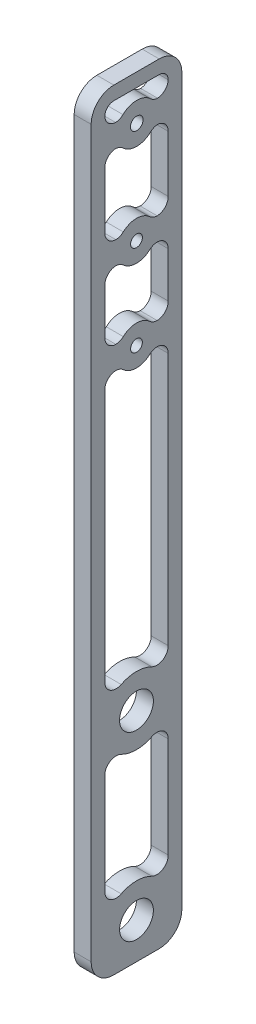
ISO-10303-21;
HEADER;
FILE_DESCRIPTION(('STEP AP214'),'2;1');
FILE_NAME('part.step','',(''),(''),'','','');
FILE_SCHEMA(('AUTOMOTIVE_DESIGN { 1 0 10303 214 1 1 1 1 }'));
ENDSEC;
DATA;
#1=APPLICATION_CONTEXT('core data for automotive mechanical design processes');
#2=APPLICATION_PROTOCOL_DEFINITION('international standard','automotive_design',2000,#1);
#3=PRODUCT_CONTEXT('',#1,'mechanical');
#4=PRODUCT('Part','Part','',(#3));
#5=PRODUCT_RELATED_PRODUCT_CATEGORY('part','',(#4));
#6=PRODUCT_DEFINITION_FORMATION('','',#4);
#7=PRODUCT_DEFINITION_CONTEXT('part definition',#1,'design');
#8=PRODUCT_DEFINITION('design','',#6,#7);
#9=PRODUCT_DEFINITION_SHAPE('','',#8);
#10=(LENGTH_UNIT() NAMED_UNIT(*) SI_UNIT(.MILLI.,.METRE.));
#11=(NAMED_UNIT(*) PLANE_ANGLE_UNIT() SI_UNIT($,.RADIAN.));
#12=(NAMED_UNIT(*) SI_UNIT($,.STERADIAN.) SOLID_ANGLE_UNIT());
#13=UNCERTAINTY_MEASURE_WITH_UNIT(LENGTH_MEASURE(1.E-05),#10,'distance_accuracy_value','');
#14=(GEOMETRIC_REPRESENTATION_CONTEXT(3) GLOBAL_UNCERTAINTY_ASSIGNED_CONTEXT((#13)) GLOBAL_UNIT_ASSIGNED_CONTEXT((#10,
#11,#12)) REPRESENTATION_CONTEXT('',''));
#15=CARTESIAN_POINT('',(0.,0.,0.));
#16=DIRECTION('',(0.,0.,1.));
#17=DIRECTION('',(1.,0.,0.));
#18=AXIS2_PLACEMENT_3D('',#15,#16,#17);
#19=CARTESIAN_POINT('',(4.7625,0.,0.));
#20=DIRECTION('',(-1.,0.,0.));
#21=DIRECTION('',(0.,0.,1.));
#22=AXIS2_PLACEMENT_3D('',#19,#20,#21);
#23=PLANE('',#22);
#24=CARTESIAN_POINT('',(4.7625,35.2327638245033,5.71499999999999));
#25=DIRECTION('',(-1.,0.,0.));
#26=DIRECTION('',(0.,0.,1.));
#27=AXIS2_PLACEMENT_3D('',#24,#25,#26);
#28=CIRCLE('',#27,3.175);
#29=CARTESIAN_POINT('',(4.7625,35.2327638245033,8.88999999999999));
#30=VERTEX_POINT('',#29);
#31=CARTESIAN_POINT('',(4.7625,38.4070136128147,5.78401652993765));
#32=VERTEX_POINT('',#31);
#33=EDGE_CURVE('E679',#30,#32,#28,.T.);
#34=ORIENTED_EDGE('',*,*,#33,.T.);
#35=CARTESIAN_POINT('',(4.7625,35.2327638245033,5.85303305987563));
#36=DIRECTION('',(-1.,0.,0.));
#37=DIRECTION('',(0.,0.,1.));
#38=AXIS2_PLACEMENT_3D('',#35,#36,#37);
#39=CIRCLE('',#38,3.175);
#40=CARTESIAN_POINT('',(4.7625,37.5673226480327,3.70118267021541));
#41=VERTEX_POINT('',#40);
#42=EDGE_CURVE('E683',#32,#41,#39,.T.);
#43=ORIENTED_EDGE('',*,*,#42,.T.);
#44=CARTESIAN_POINT('',(4.7625,41.5827638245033,-1.09287578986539E-13));
#45=DIRECTION('',(1.,0.,0.));
#46=DIRECTION('',(0.,0.,-1.));
#47=AXIS2_PLACEMENT_3D('',#44,#45,#46);
#48=CIRCLE('',#47,5.46099999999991);
#49=CARTESIAN_POINT('',(4.7625,37.5673226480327,-3.70118267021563));
#50=VERTEX_POINT('',#49);
#51=EDGE_CURVE('E475',#41,#50,#48,.T.);
#52=ORIENTED_EDGE('',*,*,#51,.T.);
#53=CARTESIAN_POINT('',(4.7625,35.2327638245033,-5.85303305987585));
#54=DIRECTION('',(-1.,0.,0.));
#55=DIRECTION('',(0.,0.,1.));
#56=AXIS2_PLACEMENT_3D('',#53,#54,#55);
#57=CIRCLE('',#56,3.175);
#58=CARTESIAN_POINT('',(4.7625,38.4070136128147,-5.78401652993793));
#59=VERTEX_POINT('',#58);
#60=EDGE_CURVE('E687',#50,#59,#57,.T.);
#61=ORIENTED_EDGE('',*,*,#60,.T.);
#62=CARTESIAN_POINT('',(4.7625,35.2327638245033,-5.715));
#63=DIRECTION('',(-1.,0.,0.));
#64=DIRECTION('',(0.,0.,1.));
#65=AXIS2_PLACEMENT_3D('',#62,#63,#64);
#66=CIRCLE('',#65,3.175);
#67=CARTESIAN_POINT('',(4.7625,35.2327638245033,-8.89));
#68=VERTEX_POINT('',#67);
#69=EDGE_CURVE('E691',#59,#68,#66,.T.);
#70=ORIENTED_EDGE('',*,*,#69,.T.);
#71=DIRECTION('',(0.,1.,0.));
#72=VECTOR('',#71,1.);
#73=CARTESIAN_POINT('',(4.7625,0.,-8.89));
#74=LINE('',#73,#72);
#75=CARTESIAN_POINT('',(4.7625,-35.6769871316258,-8.89));
#76=VERTEX_POINT('',#75);
#77=EDGE_CURVE('E469',#76,#68,#74,.T.);
#78=ORIENTED_EDGE('',*,*,#77,.F.);
#79=CARTESIAN_POINT('',(4.7625,-35.6769871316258,-5.715));
#80=DIRECTION('',(-1.,0.,0.));
#81=DIRECTION('',(0.,0.,1.));
#82=AXIS2_PLACEMENT_3D('',#79,#80,#81);
#83=CIRCLE('',#82,3.175);
#84=CARTESIAN_POINT('',(4.7625,-38.5109081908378,-4.2833867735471));
#85=VERTEX_POINT('',#84);
#86=EDGE_CURVE('E850',#76,#85,#83,.T.);
#87=ORIENTED_EDGE('',*,*,#86,.T.);
#88=CARTESIAN_POINT('',(4.7625,-46.99,0.));
#89=DIRECTION('',(1.,0.,0.));
#90=DIRECTION('',(0.,0.,-1.));
#91=AXIS2_PLACEMENT_3D('',#88,#89,#90);
#92=CIRCLE('',#91,9.4996);
#93=CARTESIAN_POINT('',(4.7625,-38.5109081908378,4.28338677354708));
#94=VERTEX_POINT('',#93);
#95=EDGE_CURVE('E481',#85,#94,#92,.T.);
#96=ORIENTED_EDGE('',*,*,#95,.T.);
#97=CARTESIAN_POINT('',(4.7625,-35.6769871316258,5.71499999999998));
#98=DIRECTION('',(-1.,0.,0.));
#99=DIRECTION('',(0.,0.,1.));
#100=AXIS2_PLACEMENT_3D('',#97,#98,#99);
#101=CIRCLE('',#100,3.175);
#102=CARTESIAN_POINT('',(4.7625,-35.6769871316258,8.88999999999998));
#103=VERTEX_POINT('',#102);
#104=EDGE_CURVE('E46',#94,#103,#101,.T.);
#105=ORIENTED_EDGE('',*,*,#104,.T.);
#106=DIRECTION('',(0.,-1.,0.));
#107=VECTOR('',#106,1.);
#108=CARTESIAN_POINT('',(4.7625,0.,8.88999999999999));
#109=LINE('',#108,#107);
#110=EDGE_CURVE('E478',#30,#103,#109,.T.);
#111=ORIENTED_EDGE('',*,*,#110,.F.);
#112=EDGE_LOOP('',(#34,#43,#52,#61,#70,#78,#87,#96,#105,#111));
#113=FACE_BOUND('',#112,.T.);
#114=CARTESIAN_POINT('',(4.7625,73.3327638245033,-5.715));
#115=DIRECTION('',(-1.,0.,0.));
#116=DIRECTION('',(0.,0.,1.));
#117=AXIS2_PLACEMENT_3D('',#114,#115,#116);
#118=CIRCLE('',#117,3.175);
#119=CARTESIAN_POINT('',(4.7625,73.3327638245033,-8.89));
#120=VERTEX_POINT('',#119);
#121=CARTESIAN_POINT('',(4.7625,70.1585140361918,-5.78401652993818));
#122=VERTEX_POINT('',#121);
#123=EDGE_CURVE('E728',#120,#122,#118,.T.);
#124=ORIENTED_EDGE('',*,*,#123,.T.);
#125=CARTESIAN_POINT('',(4.7625,73.3327638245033,-5.85303305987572));
#126=DIRECTION('',(-1.,0.,0.));
#127=DIRECTION('',(0.,0.,1.));
#128=AXIS2_PLACEMENT_3D('',#125,#126,#127);
#129=CIRCLE('',#128,3.175);
#130=CARTESIAN_POINT('',(4.7625,70.9982050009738,-3.70118267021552));
#131=VERTEX_POINT('',#130);
#132=EDGE_CURVE('E732',#122,#131,#129,.T.);
#133=ORIENTED_EDGE('',*,*,#132,.T.);
#134=CARTESIAN_POINT('',(4.7625,66.9827638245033,-1.05384451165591E-13));
#135=DIRECTION('',(1.,0.,0.));
#136=DIRECTION('',(0.,0.,-1.));
#137=AXIS2_PLACEMENT_3D('',#134,#135,#136);
#138=CIRCLE('',#137,5.46099999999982);
#139=CARTESIAN_POINT('',(4.7625,70.9982050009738,3.70118267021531));
#140=VERTEX_POINT('',#139);
#141=EDGE_CURVE('E522',#131,#140,#138,.T.);
#142=ORIENTED_EDGE('',*,*,#141,.T.);
#143=CARTESIAN_POINT('',(4.7625,73.3327638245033,5.85303305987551));
#144=DIRECTION('',(-1.,0.,0.));
#145=DIRECTION('',(0.,0.,1.));
#146=AXIS2_PLACEMENT_3D('',#143,#144,#145);
#147=CIRCLE('',#146,3.175);
#148=CARTESIAN_POINT('',(4.7625,70.1585140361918,5.78401652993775));
#149=VERTEX_POINT('',#148);
#150=EDGE_CURVE('E736',#140,#149,#147,.T.);
#151=ORIENTED_EDGE('',*,*,#150,.T.);
#152=CARTESIAN_POINT('',(4.7625,73.3327638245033,5.715));
#153=DIRECTION('',(-1.,0.,0.));
#154=DIRECTION('',(0.,0.,1.));
#155=AXIS2_PLACEMENT_3D('',#152,#153,#154);
#156=CIRCLE('',#155,3.175);
#157=CARTESIAN_POINT('',(4.7625,73.3327638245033,8.89));
#158=VERTEX_POINT('',#157);
#159=EDGE_CURVE('E740',#149,#158,#156,.T.);
#160=ORIENTED_EDGE('',*,*,#159,.T.);
#161=DIRECTION('',(0.,-1.,0.));
#162=VECTOR('',#161,1.);
#163=CARTESIAN_POINT('',(4.7625,0.,8.88999999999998));
#164=LINE('',#163,#162);
#165=CARTESIAN_POINT('',(4.7625,89.1047079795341,8.89));
#166=VERTEX_POINT('',#165);
#167=EDGE_CURVE('E512',#166,#158,#164,.T.);
#168=ORIENTED_EDGE('',*,*,#167,.F.);
#169=CARTESIAN_POINT('',(4.7625,89.1047079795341,5.715));
#170=DIRECTION('',(-1.,0.,0.));
#171=DIRECTION('',(0.,0.,1.));
#172=AXIS2_PLACEMENT_3D('',#169,#170,#171);
#173=CIRCLE('',#172,3.175);
#174=CARTESIAN_POINT('',(4.7625,92.2770526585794,5.84482387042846));
#175=VERTEX_POINT('',#174);
#176=EDGE_CURVE('E748',#166,#175,#173,.T.);
#177=ORIENTED_EDGE('',*,*,#176,.T.);
#178=CARTESIAN_POINT('',(4.7625,89.1047079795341,5.97464774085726));
#179=DIRECTION('',(-1.,0.,0.));
#180=DIRECTION('',(0.,0.,1.));
#181=AXIS2_PLACEMENT_3D('',#178,#179,#180);
#182=CIRCLE('',#181,3.175);
#183=CARTESIAN_POINT('',(4.7625,91.4054326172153,3.78665982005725));
#184=VERTEX_POINT('',#183);
#185=EDGE_CURVE('E752',#175,#184,#182,.T.);
#186=ORIENTED_EDGE('',*,*,#185,.T.);
#187=CARTESIAN_POINT('',(4.7625,95.4547079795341,-0.0641989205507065));
#188=DIRECTION('',(1.,0.,0.));
#189=DIRECTION('',(0.,0.,-1.));
#190=AXIS2_PLACEMENT_3D('',#187,#188,#189);
#191=CIRCLE('',#190,5.58799999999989);
#192=CARTESIAN_POINT('',(4.7625,91.4054326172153,-3.91505766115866));
#193=VERTEX_POINT('',#192);
#194=EDGE_CURVE('E529',#184,#193,#191,.T.);
#195=ORIENTED_EDGE('',*,*,#194,.T.);
#196=CARTESIAN_POINT('',(4.7625,89.1047079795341,-6.10304558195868));
#197=DIRECTION('',(-1.,0.,0.));
#198=DIRECTION('',(0.,0.,1.));
#199=AXIS2_PLACEMENT_3D('',#196,#197,#198);
#200=CIRCLE('',#199,3.175);
#201=CARTESIAN_POINT('',(4.7625,92.2737741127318,-5.90902279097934));
#202=VERTEX_POINT('',#201);
#203=EDGE_CURVE('E760',#193,#202,#200,.T.);
#204=ORIENTED_EDGE('',*,*,#203,.T.);
#205=CARTESIAN_POINT('',(4.7625,89.1047079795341,-5.715));
#206=DIRECTION('',(-1.,0.,0.));
#207=DIRECTION('',(0.,0.,1.));
#208=AXIS2_PLACEMENT_3D('',#205,#206,#207);
#209=CIRCLE('',#208,3.175);
#210=CARTESIAN_POINT('',(4.7625,89.1047079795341,-8.89));
#211=VERTEX_POINT('',#210);
#212=EDGE_CURVE('E767',#202,#211,#209,.T.);
#213=ORIENTED_EDGE('',*,*,#212,.T.);
#214=DIRECTION('',(0.,1.,0.));
#215=VECTOR('',#214,1.);
#216=CARTESIAN_POINT('',(4.7625,0.,-8.89));
#217=LINE('',#216,#215);
#218=EDGE_CURVE('E525',#120,#211,#217,.T.);
#219=ORIENTED_EDGE('',*,*,#218,.F.);
#220=EDGE_LOOP('',(#124,#133,#142,#151,#160,#168,#177,#186,#195,#204,#213,#219));
#221=FACE_BOUND('',#220,.T.);
#222=CARTESIAN_POINT('',(4.7625,41.5827638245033,-1.09287578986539E-13));
#223=DIRECTION('',(-1.,0.,0.));
#224=DIRECTION('',(0.,0.,1.));
#225=AXIS2_PLACEMENT_3D('',#222,#223,#224);
#226=CIRCLE('',#225,1.651);
#227=CARTESIAN_POINT('',(4.7625,41.5827638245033,1.65099999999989));
#228=VERTEX_POINT('',#227);
#229=EDGE_CURVE('E534',#228,#228,#226,.T.);
#230=ORIENTED_EDGE('',*,*,#229,.T.);
#231=EDGE_LOOP('',(#230));
#232=FACE_BOUND('',#231,.T.);
#233=CARTESIAN_POINT('',(4.7625,66.9827638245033,-1.05384451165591E-13));
#234=DIRECTION('',(-1.,0.,0.));
#235=DIRECTION('',(0.,0.,1.));
#236=AXIS2_PLACEMENT_3D('',#233,#234,#235);
#237=CIRCLE('',#236,1.6509999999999);
#238=CARTESIAN_POINT('',(4.7625,66.9827638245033,1.6509999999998));
#239=VERTEX_POINT('',#238);
#240=EDGE_CURVE('E541',#239,#239,#237,.T.);
#241=ORIENTED_EDGE('',*,*,#240,.T.);
#242=EDGE_LOOP('',(#241));
#243=FACE_BOUND('',#242,.T.);
#244=CARTESIAN_POINT('',(4.7625,95.4547079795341,-0.0641989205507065));
#245=DIRECTION('',(-1.,0.,0.));
#246=DIRECTION('',(0.,0.,1.));
#247=AXIS2_PLACEMENT_3D('',#244,#245,#246);
#248=CIRCLE('',#247,1.77799999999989);
#249=CARTESIAN_POINT('',(4.7625,95.4547079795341,1.71380107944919));
#250=VERTEX_POINT('',#249);
#251=EDGE_CURVE('E547',#250,#250,#248,.T.);
#252=ORIENTED_EDGE('',*,*,#251,.T.);
#253=EDGE_LOOP('',(#252));
#254=FACE_BOUND('',#253,.T.);
#255=DIRECTION('',(0.,-1.,0.));
#256=VECTOR('',#255,1.);
#257=CARTESIAN_POINT('',(4.7625,-107.95,12.7));
#258=LINE('',#257,#256);
#259=CARTESIAN_POINT('',(4.7625,101.6,12.7));
#260=VERTEX_POINT('',#259);
#261=CARTESIAN_POINT('',(4.7625,-101.6,12.7));
#262=VERTEX_POINT('',#261);
#263=EDGE_CURVE('E571',#260,#262,#258,.T.);
#264=ORIENTED_EDGE('',*,*,#263,.T.);
#265=CARTESIAN_POINT('',(4.7625,-101.6,6.35));
#266=DIRECTION('',(-1.,0.,0.));
#267=DIRECTION('',(0.,0.,1.));
#268=AXIS2_PLACEMENT_3D('',#265,#266,#267);
#269=CIRCLE('',#268,6.35);
#270=CARTESIAN_POINT('',(4.7625,-107.95,6.35));
#271=VERTEX_POINT('',#270);
#272=EDGE_CURVE('E611',#262,#271,#269,.F.);
#273=ORIENTED_EDGE('',*,*,#272,.T.);
#274=DIRECTION('',(0.,0.,-1.));
#275=VECTOR('',#274,1.);
#276=CARTESIAN_POINT('',(4.7625,-107.95,12.7));
#277=LINE('',#276,#275);
#278=CARTESIAN_POINT('',(4.7625,-107.95,-6.35));
#279=VERTEX_POINT('',#278);
#280=EDGE_CURVE('E574',#271,#279,#277,.T.);
#281=ORIENTED_EDGE('',*,*,#280,.T.);
#282=CARTESIAN_POINT('',(4.7625,-101.6,-6.35));
#283=DIRECTION('',(-1.,0.,0.));
#284=DIRECTION('',(0.,0.,1.));
#285=AXIS2_PLACEMENT_3D('',#282,#283,#284);
#286=CIRCLE('',#285,6.35);
#287=CARTESIAN_POINT('',(4.7625,-101.6,-12.7));
#288=VERTEX_POINT('',#287);
#289=EDGE_CURVE('E609',#279,#288,#286,.F.);
#290=ORIENTED_EDGE('',*,*,#289,.T.);
#291=DIRECTION('',(0.,1.,0.));
#292=VECTOR('',#291,1.);
#293=CARTESIAN_POINT('',(4.7625,-107.95,-12.7));
#294=LINE('',#293,#292);
#295=CARTESIAN_POINT('',(4.7625,101.6,-12.7));
#296=VERTEX_POINT('',#295);
#297=EDGE_CURVE('E564',#288,#296,#294,.T.);
#298=ORIENTED_EDGE('',*,*,#297,.T.);
#299=CARTESIAN_POINT('',(4.7625,101.6,-6.35));
#300=DIRECTION('',(-1.,0.,0.));
#301=DIRECTION('',(0.,0.,1.));
#302=AXIS2_PLACEMENT_3D('',#299,#300,#301);
#303=CIRCLE('',#302,6.35);
#304=CARTESIAN_POINT('',(4.7625,107.95,-6.35));
#305=VERTEX_POINT('',#304);
#306=EDGE_CURVE('E607',#296,#305,#303,.F.);
#307=ORIENTED_EDGE('',*,*,#306,.T.);
#308=DIRECTION('',(0.,0.,1.));
#309=VECTOR('',#308,1.);
#310=CARTESIAN_POINT('',(4.7625,107.95,12.7));
#311=LINE('',#310,#309);
#312=CARTESIAN_POINT('',(4.7625,107.95,6.35));
#313=VERTEX_POINT('',#312);
#314=EDGE_CURVE('E567',#305,#313,#311,.T.);
#315=ORIENTED_EDGE('',*,*,#314,.T.);
#316=CARTESIAN_POINT('',(4.7625,101.6,6.35));
#317=DIRECTION('',(-1.,0.,0.));
#318=DIRECTION('',(0.,0.,1.));
#319=AXIS2_PLACEMENT_3D('',#316,#317,#318);
#320=CIRCLE('',#319,6.35);
#321=EDGE_CURVE('E605',#313,#260,#320,.F.);
#322=ORIENTED_EDGE('',*,*,#321,.T.);
#323=EDGE_LOOP('',(#264,#273,#281,#290,#298,#307,#315,#322));
#324=FACE_BOUND('',#323,.T.);
#325=CARTESIAN_POINT('',(4.7625,-97.79,0.));
#326=DIRECTION('',(1.,0.,0.));
#327=DIRECTION('',(0.,0.,-1.));
#328=AXIS2_PLACEMENT_3D('',#325,#326,#327);
#329=CIRCLE('',#328,4.73709999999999);
#330=CARTESIAN_POINT('',(4.7625,-97.79,4.73709999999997));
#331=VERTEX_POINT('',#330);
#332=EDGE_CURVE('E558',#331,#331,#329,.T.);
#333=ORIENTED_EDGE('',*,*,#332,.F.);
#334=EDGE_LOOP('',(#333));
#335=FACE_BOUND('',#334,.T.);
#336=CARTESIAN_POINT('',(4.7625,-46.99,0.));
#337=DIRECTION('',(1.,0.,0.));
#338=DIRECTION('',(0.,0.,-1.));
#339=AXIS2_PLACEMENT_3D('',#336,#337,#338);
#340=CIRCLE('',#339,4.7371);
#341=CARTESIAN_POINT('',(4.7625,-46.99,4.73709999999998));
#342=VERTEX_POINT('',#341);
#343=EDGE_CURVE('E552',#342,#342,#340,.T.);
#344=ORIENTED_EDGE('',*,*,#343,.F.);
#345=EDGE_LOOP('',(#344));
#346=FACE_BOUND('',#345,.T.);
#347=CARTESIAN_POINT('',(4.7625,101.6,-6.35));
#348=DIRECTION('',(1.,0.,0.));
#349=DIRECTION('',(0.,0.,-1.));
#350=AXIS2_PLACEMENT_3D('',#347,#348,#349);
#351=CIRCLE('',#350,2.54);
#352=CARTESIAN_POINT('',(4.7625,101.6,-8.89));
#353=VERTEX_POINT('',#352);
#354=CARTESIAN_POINT('',(4.7625,104.14,-6.35));
#355=VERTEX_POINT('',#354);
#356=EDGE_CURVE('E452',#353,#355,#351,.T.);
#357=ORIENTED_EDGE('',*,*,#356,.F.);
#358=CARTESIAN_POINT('',(4.7625,101.804707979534,-5.72160614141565));
#359=DIRECTION('',(-1.,0.,0.));
#360=DIRECTION('',(0.,0.,1.));
#361=AXIS2_PLACEMENT_3D('',#358,#359,#360);
#362=CIRCLE('',#361,3.175);
#363=CARTESIAN_POINT('',(4.7625,98.6354413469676,-5.91232586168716));
#364=VERTEX_POINT('',#363);
#365=EDGE_CURVE('E416',#353,#364,#362,.T.);
#366=ORIENTED_EDGE('',*,*,#365,.T.);
#367=CARTESIAN_POINT('',(4.7625,101.804707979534,-6.10304558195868));
#368=DIRECTION('',(-1.,0.,0.));
#369=DIRECTION('',(0.,0.,1.));
#370=AXIS2_PLACEMENT_3D('',#367,#368,#369);
#371=CIRCLE('',#370,3.175);
#372=CARTESIAN_POINT('',(4.7625,99.5039833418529,-3.91505766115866));
#373=VERTEX_POINT('',#372);
#374=EDGE_CURVE('E764',#364,#373,#371,.T.);
#375=ORIENTED_EDGE('',*,*,#374,.T.);
#376=CARTESIAN_POINT('',(4.7625,95.4547079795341,-0.0641989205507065));
#377=DIRECTION('',(1.,0.,0.));
#378=DIRECTION('',(0.,0.,-1.));
#379=AXIS2_PLACEMENT_3D('',#376,#377,#378);
#380=CIRCLE('',#379,5.58799999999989);
#381=CARTESIAN_POINT('',(4.7625,99.5039833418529,3.78665982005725));
#382=VERTEX_POINT('',#381);
#383=EDGE_CURVE('E426',#373,#382,#380,.T.);
#384=ORIENTED_EDGE('',*,*,#383,.T.);
#385=CARTESIAN_POINT('',(4.7625,101.804707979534,5.97464774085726));
#386=DIRECTION('',(-1.,0.,0.));
#387=DIRECTION('',(0.,0.,1.));
#388=AXIS2_PLACEMENT_3D('',#385,#386,#387);
#389=CIRCLE('',#388,3.175);
#390=CARTESIAN_POINT('',(4.7625,98.6322298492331,5.84812694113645));
#391=VERTEX_POINT('',#390);
#392=EDGE_CURVE('E756',#382,#391,#389,.T.);
#393=ORIENTED_EDGE('',*,*,#392,.T.);
#394=CARTESIAN_POINT('',(4.7625,101.804707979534,5.72160614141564));
#395=DIRECTION('',(-1.,0.,0.));
#396=DIRECTION('',(0.,0.,1.));
#397=AXIS2_PLACEMENT_3D('',#394,#395,#396);
#398=CIRCLE('',#397,3.175);
#399=CARTESIAN_POINT('',(4.7625,101.6,8.89));
#400=VERTEX_POINT('',#399);
#401=EDGE_CURVE('E744',#391,#400,#398,.T.);
#402=ORIENTED_EDGE('',*,*,#401,.T.);
#403=CARTESIAN_POINT('',(4.7625,101.6,6.35));
#404=DIRECTION('',(1.,0.,0.));
#405=DIRECTION('',(0.,0.,-1.));
#406=AXIS2_PLACEMENT_3D('',#403,#404,#405);
#407=CIRCLE('',#406,2.54);
#408=CARTESIAN_POINT('',(4.7625,104.14,6.35));
#409=VERTEX_POINT('',#408);
#410=EDGE_CURVE('E1580',#409,#400,#407,.T.);
#411=ORIENTED_EDGE('',*,*,#410,.F.);
#412=DIRECTION('',(0.,0.,1.));
#413=VECTOR('',#412,1.);
#414=CARTESIAN_POINT('',(4.7625,104.14,0.));
#415=LINE('',#414,#413);
#416=EDGE_CURVE('E1582',#355,#409,#415,.T.);
#417=ORIENTED_EDGE('',*,*,#416,.F.);
#418=EDGE_LOOP('',(#357,#366,#375,#384,#393,#402,#411,#417));
#419=FACE_BOUND('',#418,.T.);
#420=DIRECTION('',(0.,-1.,0.));
#421=VECTOR('',#420,1.);
#422=CARTESIAN_POINT('',(4.7625,0.,8.88999999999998));
#423=LINE('',#422,#421);
#424=CARTESIAN_POINT('',(4.7625,60.6327638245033,8.88999999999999));
#425=VERTEX_POINT('',#424);
#426=CARTESIAN_POINT('',(4.7625,47.9327638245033,8.88999999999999));
#427=VERTEX_POINT('',#426);
#428=EDGE_CURVE('E456',#425,#427,#423,.T.);
#429=ORIENTED_EDGE('',*,*,#428,.F.);
#430=CARTESIAN_POINT('',(4.7625,60.6327638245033,5.715));
#431=DIRECTION('',(-1.,0.,0.));
#432=DIRECTION('',(0.,0.,1.));
#433=AXIS2_PLACEMENT_3D('',#430,#431,#432);
#434=CIRCLE('',#433,3.175);
#435=CARTESIAN_POINT('',(4.7625,63.8070136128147,5.78401652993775));
#436=VERTEX_POINT('',#435);
#437=EDGE_CURVE('E720',#425,#436,#434,.T.);
#438=ORIENTED_EDGE('',*,*,#437,.T.);
#439=CARTESIAN_POINT('',(4.7625,60.6327638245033,5.85303305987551));
#440=DIRECTION('',(-1.,0.,0.));
#441=DIRECTION('',(0.,0.,1.));
#442=AXIS2_PLACEMENT_3D('',#439,#440,#441);
#443=CIRCLE('',#442,3.175);
#444=CARTESIAN_POINT('',(4.7625,62.9673226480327,3.70118267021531));
#445=VERTEX_POINT('',#444);
#446=EDGE_CURVE('E712',#436,#445,#443,.T.);
#447=ORIENTED_EDGE('',*,*,#446,.T.);
#448=CARTESIAN_POINT('',(4.7625,66.9827638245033,-1.05384451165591E-13));
#449=DIRECTION('',(1.,0.,0.));
#450=DIRECTION('',(0.,0.,-1.));
#451=AXIS2_PLACEMENT_3D('',#448,#449,#450);
#452=CIRCLE('',#451,5.46099999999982);
#453=CARTESIAN_POINT('',(4.7625,62.9673226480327,-3.70118267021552));
#454=VERTEX_POINT('',#453);
#455=EDGE_CURVE('E453',#445,#454,#452,.T.);
#456=ORIENTED_EDGE('',*,*,#455,.T.);
#457=CARTESIAN_POINT('',(4.7625,60.6327638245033,-5.85303305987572));
#458=DIRECTION('',(-1.,0.,0.));
#459=DIRECTION('',(0.,0.,1.));
#460=AXIS2_PLACEMENT_3D('',#457,#458,#459);
#461=CIRCLE('',#460,3.175);
#462=CARTESIAN_POINT('',(4.7625,63.8070136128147,-5.78401652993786));
#463=VERTEX_POINT('',#462);
#464=EDGE_CURVE('E724',#454,#463,#461,.T.);
#465=ORIENTED_EDGE('',*,*,#464,.T.);
#466=CARTESIAN_POINT('',(4.7625,60.6327638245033,-5.715));
#467=DIRECTION('',(-1.,0.,0.));
#468=DIRECTION('',(0.,0.,1.));
#469=AXIS2_PLACEMENT_3D('',#466,#467,#468);
#470=CIRCLE('',#469,3.175);
#471=CARTESIAN_POINT('',(4.7625,60.6327638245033,-8.89));
#472=VERTEX_POINT('',#471);
#473=EDGE_CURVE('E716',#463,#472,#470,.T.);
#474=ORIENTED_EDGE('',*,*,#473,.T.);
#475=DIRECTION('',(0.,1.,0.));
#476=VECTOR('',#475,1.);
#477=CARTESIAN_POINT('',(4.7625,0.,-8.89));
#478=LINE('',#477,#476);
#479=CARTESIAN_POINT('',(4.7625,47.9327638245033,-8.89));
#480=VERTEX_POINT('',#479);
#481=EDGE_CURVE('E443',#480,#472,#478,.T.);
#482=ORIENTED_EDGE('',*,*,#481,.F.);
#483=CARTESIAN_POINT('',(4.7625,47.9327638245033,-5.715));
#484=DIRECTION('',(-1.,0.,0.));
#485=DIRECTION('',(0.,0.,1.));
#486=AXIS2_PLACEMENT_3D('',#483,#484,#485);
#487=CIRCLE('',#486,3.175);
#488=CARTESIAN_POINT('',(4.7625,44.7585140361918,-5.78401652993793));
#489=VERTEX_POINT('',#488);
#490=EDGE_CURVE('E696',#480,#489,#487,.T.);
#491=ORIENTED_EDGE('',*,*,#490,.T.);
#492=CARTESIAN_POINT('',(4.7625,47.9327638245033,-5.85303305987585));
#493=DIRECTION('',(-1.,0.,0.));
#494=DIRECTION('',(0.,0.,1.));
#495=AXIS2_PLACEMENT_3D('',#492,#493,#494);
#496=CIRCLE('',#495,3.175);
#497=CARTESIAN_POINT('',(4.7625,45.5982050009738,-3.70118267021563));
#498=VERTEX_POINT('',#497);
#499=EDGE_CURVE('E700',#489,#498,#496,.T.);
#500=ORIENTED_EDGE('',*,*,#499,.T.);
#501=CARTESIAN_POINT('',(4.7625,41.5827638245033,-1.09287578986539E-13));
#502=DIRECTION('',(1.,0.,0.));
#503=DIRECTION('',(0.,0.,-1.));
#504=AXIS2_PLACEMENT_3D('',#501,#502,#503);
#505=CIRCLE('',#504,5.46099999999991);
#506=CARTESIAN_POINT('',(4.7625,45.5982050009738,3.70118267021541));
#507=VERTEX_POINT('',#506);
#508=EDGE_CURVE('E460',#498,#507,#505,.T.);
#509=ORIENTED_EDGE('',*,*,#508,.T.);
#510=CARTESIAN_POINT('',(4.7625,47.9327638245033,5.85303305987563));
#511=DIRECTION('',(-1.,0.,0.));
#512=DIRECTION('',(0.,0.,1.));
#513=AXIS2_PLACEMENT_3D('',#510,#511,#512);
#514=CIRCLE('',#513,3.175);
#515=CARTESIAN_POINT('',(4.7625,44.7585140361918,5.78401652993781));
#516=VERTEX_POINT('',#515);
#517=EDGE_CURVE('E704',#507,#516,#514,.T.);
#518=ORIENTED_EDGE('',*,*,#517,.T.);
#519=CARTESIAN_POINT('',(4.7625,47.9327638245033,5.71499999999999));
#520=DIRECTION('',(-1.,0.,0.));
#521=DIRECTION('',(0.,0.,1.));
#522=AXIS2_PLACEMENT_3D('',#519,#520,#521);
#523=CIRCLE('',#522,3.175);
#524=EDGE_CURVE('E708',#516,#427,#523,.T.);
#525=ORIENTED_EDGE('',*,*,#524,.T.);
#526=EDGE_LOOP('',(#429,#438,#447,#456,#465,#474,#482,#491,#500,#509,#518,#525));
#527=FACE_BOUND('',#526,.T.);
#528=DIRECTION('',(0.,-1.,0.));
#529=VECTOR('',#528,1.);
#530=CARTESIAN_POINT('',(4.7625,0.,8.88999999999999));
#531=LINE('',#530,#529);
#532=CARTESIAN_POINT('',(4.7625,-58.3030128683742,8.88999999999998));
#533=VERTEX_POINT('',#532);
#534=CARTESIAN_POINT('',(4.7625,-86.4769871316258,8.88999999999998));
#535=VERTEX_POINT('',#534);
#536=EDGE_CURVE('E499',#533,#535,#531,.T.);
#537=ORIENTED_EDGE('',*,*,#536,.F.);
#538=CARTESIAN_POINT('',(4.7625,-58.3030128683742,5.71499999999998));
#539=DIRECTION('',(-1.,0.,0.));
#540=DIRECTION('',(0.,0.,1.));
#541=AXIS2_PLACEMENT_3D('',#538,#539,#540);
#542=CIRCLE('',#541,3.175);
#543=CARTESIAN_POINT('',(4.7625,-55.4690918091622,4.28338677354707));
#544=VERTEX_POINT('',#543);
#545=EDGE_CURVE('E842',#533,#544,#542,.T.);
#546=ORIENTED_EDGE('',*,*,#545,.T.);
#547=CARTESIAN_POINT('',(4.7625,-46.99,0.));
#548=DIRECTION('',(1.,0.,0.));
#549=DIRECTION('',(0.,0.,-1.));
#550=AXIS2_PLACEMENT_3D('',#547,#548,#549);
#551=CIRCLE('',#550,9.4996);
#552=CARTESIAN_POINT('',(4.7625,-55.4690918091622,-4.2833867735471));
#553=VERTEX_POINT('',#552);
#554=EDGE_CURVE('E496',#544,#553,#551,.T.);
#555=ORIENTED_EDGE('',*,*,#554,.T.);
#556=CARTESIAN_POINT('',(4.7625,-58.3030128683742,-5.715));
#557=DIRECTION('',(-1.,0.,0.));
#558=DIRECTION('',(0.,0.,1.));
#559=AXIS2_PLACEMENT_3D('',#556,#557,#558);
#560=CIRCLE('',#559,3.175);
#561=CARTESIAN_POINT('',(4.7625,-58.3030128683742,-8.89));
#562=VERTEX_POINT('',#561);
#563=EDGE_CURVE('E846',#553,#562,#560,.T.);
#564=ORIENTED_EDGE('',*,*,#563,.T.);
#565=DIRECTION('',(0.,1.,0.));
#566=VECTOR('',#565,1.);
#567=CARTESIAN_POINT('',(4.7625,0.,-8.89));
#568=LINE('',#567,#566);
#569=CARTESIAN_POINT('',(4.7625,-86.4769871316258,-8.89));
#570=VERTEX_POINT('',#569);
#571=EDGE_CURVE('E488',#570,#562,#568,.T.);
#572=ORIENTED_EDGE('',*,*,#571,.F.);
#573=CARTESIAN_POINT('',(4.7625,-86.4769871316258,-5.715));
#574=DIRECTION('',(-1.,0.,0.));
#575=DIRECTION('',(0.,0.,1.));
#576=AXIS2_PLACEMENT_3D('',#573,#574,#575);
#577=CIRCLE('',#576,3.175);
#578=CARTESIAN_POINT('',(4.7625,-89.3109081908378,-4.28338677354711));
#579=VERTEX_POINT('',#578);
#580=EDGE_CURVE('E834',#570,#579,#577,.T.);
#581=ORIENTED_EDGE('',*,*,#580,.T.);
#582=CARTESIAN_POINT('',(4.7625,-97.79,0.));
#583=DIRECTION('',(1.,0.,0.));
#584=DIRECTION('',(0.,0.,-1.));
#585=AXIS2_PLACEMENT_3D('',#582,#583,#584);
#586=CIRCLE('',#585,9.4996);
#587=CARTESIAN_POINT('',(4.7625,-89.3109081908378,4.28338677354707));
#588=VERTEX_POINT('',#587);
#589=EDGE_CURVE('E503',#579,#588,#586,.T.);
#590=ORIENTED_EDGE('',*,*,#589,.T.);
#591=CARTESIAN_POINT('',(4.7625,-86.4769871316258,5.71499999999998));
#592=DIRECTION('',(-1.,0.,0.));
#593=DIRECTION('',(0.,0.,1.));
#594=AXIS2_PLACEMENT_3D('',#591,#592,#593);
#595=CIRCLE('',#594,3.175);
#596=EDGE_CURVE('E838',#588,#535,#595,.T.);
#597=ORIENTED_EDGE('',*,*,#596,.T.);
#598=EDGE_LOOP('',(#537,#546,#555,#564,#572,#581,#590,#597));
#599=FACE_BOUND('',#598,.T.);
#600=ADVANCED_FACE('F38',(#113,#221,#232,#243,#254,#324,#335,#346,#419,#527,#599),#23,.F.);
#601=CARTESIAN_POINT('',(0.,0.,0.));
#602=DIRECTION('',(-1.,0.,0.));
#603=DIRECTION('',(0.,0.,1.));
#604=AXIS2_PLACEMENT_3D('',#601,#602,#603);
#605=PLANE('',#604);
#606=CARTESIAN_POINT('',(0.,101.804707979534,-6.10304558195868));
#607=DIRECTION('',(-1.,0.,0.));
#608=DIRECTION('',(0.,0.,1.));
#609=AXIS2_PLACEMENT_3D('',#606,#607,#608);
#610=CIRCLE('',#609,3.175);
#611=CARTESIAN_POINT('',(0.,99.5039833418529,-3.91505766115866));
#612=VERTEX_POINT('',#611);
#613=CARTESIAN_POINT('',(0.,98.6354413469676,-5.91232586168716));
#614=VERTEX_POINT('',#613);
#615=EDGE_CURVE('E410',#612,#614,#610,.F.);
#616=ORIENTED_EDGE('',*,*,#615,.T.);
#617=CARTESIAN_POINT('',(0.,101.804707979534,-5.72160614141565));
#618=DIRECTION('',(-1.,0.,0.));
#619=DIRECTION('',(0.,0.,1.));
#620=AXIS2_PLACEMENT_3D('',#617,#618,#619);
#621=CIRCLE('',#620,3.175);
#622=CARTESIAN_POINT('',(0.,101.6,-8.89));
#623=VERTEX_POINT('',#622);
#624=EDGE_CURVE('E403',#614,#623,#621,.F.);
#625=ORIENTED_EDGE('',*,*,#624,.T.);
#626=CARTESIAN_POINT('',(0.,101.6,-6.35));
#627=DIRECTION('',(1.,0.,0.));
#628=DIRECTION('',(0.,0.,-1.));
#629=AXIS2_PLACEMENT_3D('',#626,#627,#628);
#630=CIRCLE('',#629,2.54);
#631=CARTESIAN_POINT('',(0.,104.14,-6.35));
#632=VERTEX_POINT('',#631);
#633=EDGE_CURVE('E408',#623,#632,#630,.T.);
#634=ORIENTED_EDGE('',*,*,#633,.T.);
#635=DIRECTION('',(0.,0.,1.));
#636=VECTOR('',#635,1.);
#637=CARTESIAN_POINT('',(0.,104.14,0.));
#638=LINE('',#637,#636);
#639=CARTESIAN_POINT('',(0.,104.14,6.35));
#640=VERTEX_POINT('',#639);
#641=EDGE_CURVE('E425',#632,#640,#638,.T.);
#642=ORIENTED_EDGE('',*,*,#641,.T.);
#643=CARTESIAN_POINT('',(0.,101.6,6.35));
#644=DIRECTION('',(1.,0.,0.));
#645=DIRECTION('',(0.,0.,-1.));
#646=AXIS2_PLACEMENT_3D('',#643,#644,#645);
#647=CIRCLE('',#646,2.54);
#648=CARTESIAN_POINT('',(0.,101.6,8.89));
#649=VERTEX_POINT('',#648);
#650=EDGE_CURVE('E435',#640,#649,#647,.T.);
#651=ORIENTED_EDGE('',*,*,#650,.T.);
#652=CARTESIAN_POINT('',(0.,101.804707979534,5.72160614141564));
#653=DIRECTION('',(-1.,0.,0.));
#654=DIRECTION('',(0.,0.,1.));
#655=AXIS2_PLACEMENT_3D('',#652,#653,#654);
#656=CIRCLE('',#655,3.175);
#657=CARTESIAN_POINT('',(0.,98.6322298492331,5.84812694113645));
#658=VERTEX_POINT('',#657);
#659=EDGE_CURVE('E746',#649,#658,#656,.F.);
#660=ORIENTED_EDGE('',*,*,#659,.T.);
#661=CARTESIAN_POINT('',(0.,101.804707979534,5.97464774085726));
#662=DIRECTION('',(-1.,0.,0.));
#663=DIRECTION('',(0.,0.,1.));
#664=AXIS2_PLACEMENT_3D('',#661,#662,#663);
#665=CIRCLE('',#664,3.175);
#666=CARTESIAN_POINT('',(0.,99.5039833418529,3.78665982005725));
#667=VERTEX_POINT('',#666);
#668=EDGE_CURVE('E758',#658,#667,#665,.F.);
#669=ORIENTED_EDGE('',*,*,#668,.T.);
#670=CARTESIAN_POINT('',(0.,95.4547079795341,-0.0641989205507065));
#671=DIRECTION('',(1.,0.,0.));
#672=DIRECTION('',(0.,0.,-1.));
#673=AXIS2_PLACEMENT_3D('',#670,#671,#672);
#674=CIRCLE('',#673,5.58799999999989);
#675=EDGE_CURVE('E430',#612,#667,#674,.T.);
#676=ORIENTED_EDGE('',*,*,#675,.F.);
#677=EDGE_LOOP('',(#616,#625,#634,#642,#651,#660,#669,#676));
#678=FACE_BOUND('',#677,.T.);
#679=CARTESIAN_POINT('',(0.,41.5827638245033,-1.09287578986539E-13));
#680=DIRECTION('',(-1.,0.,0.));
#681=DIRECTION('',(0.,0.,1.));
#682=AXIS2_PLACEMENT_3D('',#679,#680,#681);
#683=CIRCLE('',#682,1.651);
#684=CARTESIAN_POINT('',(0.,41.5827638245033,1.65099999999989));
#685=VERTEX_POINT('',#684);
#686=EDGE_CURVE('E538',#685,#685,#683,.T.);
#687=ORIENTED_EDGE('',*,*,#686,.F.);
#688=EDGE_LOOP('',(#687));
#689=FACE_BOUND('',#688,.T.);
#690=CARTESIAN_POINT('',(0.,66.9827638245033,-1.05384451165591E-13));
#691=DIRECTION('',(-1.,0.,0.));
#692=DIRECTION('',(0.,0.,1.));
#693=AXIS2_PLACEMENT_3D('',#690,#691,#692);
#694=CIRCLE('',#693,1.6509999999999);
#695=CARTESIAN_POINT('',(0.,66.9827638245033,1.6509999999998));
#696=VERTEX_POINT('',#695);
#697=EDGE_CURVE('E544',#696,#696,#694,.T.);
#698=ORIENTED_EDGE('',*,*,#697,.F.);
#699=EDGE_LOOP('',(#698));
#700=FACE_BOUND('',#699,.T.);
#701=CARTESIAN_POINT('',(0.,95.4547079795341,-0.0641989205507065));
#702=DIRECTION('',(-1.,0.,0.));
#703=DIRECTION('',(0.,0.,1.));
#704=AXIS2_PLACEMENT_3D('',#701,#702,#703);
#705=CIRCLE('',#704,1.77799999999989);
#706=CARTESIAN_POINT('',(0.,95.4547079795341,1.71380107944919));
#707=VERTEX_POINT('',#706);
#708=EDGE_CURVE('E521',#707,#707,#705,.T.);
#709=ORIENTED_EDGE('',*,*,#708,.F.);
#710=EDGE_LOOP('',(#709));
#711=FACE_BOUND('',#710,.T.);
#712=CARTESIAN_POINT('',(0.,-97.79,0.));
#713=DIRECTION('',(1.,0.,0.));
#714=DIRECTION('',(0.,0.,-1.));
#715=AXIS2_PLACEMENT_3D('',#712,#713,#714);
#716=CIRCLE('',#715,4.73709999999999);
#717=CARTESIAN_POINT('',(0.,-97.79,4.73709999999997));
#718=VERTEX_POINT('',#717);
#719=EDGE_CURVE('E555',#718,#718,#716,.T.);
#720=ORIENTED_EDGE('',*,*,#719,.T.);
#721=EDGE_LOOP('',(#720));
#722=FACE_BOUND('',#721,.T.);
#723=DIRECTION('',(0.,0.,-1.));
#724=VECTOR('',#723,1.);
#725=CARTESIAN_POINT('',(0.,-107.95,12.7));
#726=LINE('',#725,#724);
#727=CARTESIAN_POINT('',(0.,-107.95,6.35));
#728=VERTEX_POINT('',#727);
#729=CARTESIAN_POINT('',(0.,-107.95,-6.35));
#730=VERTEX_POINT('',#729);
#731=EDGE_CURVE('E568',#728,#730,#726,.T.);
#732=ORIENTED_EDGE('',*,*,#731,.F.);
#733=CARTESIAN_POINT('',(0.,-101.6,6.35));
#734=DIRECTION('',(-1.,0.,0.));
#735=DIRECTION('',(0.,0.,1.));
#736=AXIS2_PLACEMENT_3D('',#733,#734,#735);
#737=CIRCLE('',#736,6.35);
#738=CARTESIAN_POINT('',(0.,-101.6,12.7));
#739=VERTEX_POINT('',#738);
#740=EDGE_CURVE('E598',#728,#739,#737,.T.);
#741=ORIENTED_EDGE('',*,*,#740,.T.);
#742=DIRECTION('',(0.,-1.,0.));
#743=VECTOR('',#742,1.);
#744=CARTESIAN_POINT('',(0.,-107.95,12.7));
#745=LINE('',#744,#743);
#746=CARTESIAN_POINT('',(0.,101.6,12.7));
#747=VERTEX_POINT('',#746);
#748=EDGE_CURVE('E583',#747,#739,#745,.T.);
#749=ORIENTED_EDGE('',*,*,#748,.F.);
#750=CARTESIAN_POINT('',(0.,101.6,6.35));
#751=DIRECTION('',(-1.,0.,0.));
#752=DIRECTION('',(0.,0.,1.));
#753=AXIS2_PLACEMENT_3D('',#750,#751,#752);
#754=CIRCLE('',#753,6.35);
#755=CARTESIAN_POINT('',(0.,107.95,6.35));
#756=VERTEX_POINT('',#755);
#757=EDGE_CURVE('E592',#747,#756,#754,.T.);
#758=ORIENTED_EDGE('',*,*,#757,.T.);
#759=DIRECTION('',(0.,0.,1.));
#760=VECTOR('',#759,1.);
#761=CARTESIAN_POINT('',(0.,107.95,12.7));
#762=LINE('',#761,#760);
#763=CARTESIAN_POINT('',(0.,107.95,-6.35));
#764=VERTEX_POINT('',#763);
#765=EDGE_CURVE('E580',#764,#756,#762,.T.);
#766=ORIENTED_EDGE('',*,*,#765,.F.);
#767=CARTESIAN_POINT('',(0.,101.6,-6.35));
#768=DIRECTION('',(-1.,0.,0.));
#769=DIRECTION('',(0.,0.,1.));
#770=AXIS2_PLACEMENT_3D('',#767,#768,#769);
#771=CIRCLE('',#770,6.35);
#772=CARTESIAN_POINT('',(0.,101.6,-12.7));
#773=VERTEX_POINT('',#772);
#774=EDGE_CURVE('E594',#764,#773,#771,.T.);
#775=ORIENTED_EDGE('',*,*,#774,.T.);
#776=DIRECTION('',(0.,1.,0.));
#777=VECTOR('',#776,1.);
#778=CARTESIAN_POINT('',(0.,-107.95,-12.7));
#779=LINE('',#778,#777);
#780=CARTESIAN_POINT('',(0.,-101.6,-12.7));
#781=VERTEX_POINT('',#780);
#782=EDGE_CURVE('E561',#781,#773,#779,.T.);
#783=ORIENTED_EDGE('',*,*,#782,.F.);
#784=CARTESIAN_POINT('',(0.,-101.6,-6.35));
#785=DIRECTION('',(-1.,0.,0.));
#786=DIRECTION('',(0.,0.,1.));
#787=AXIS2_PLACEMENT_3D('',#784,#785,#786);
#788=CIRCLE('',#787,6.35);
#789=EDGE_CURVE('E596',#781,#730,#788,.T.);
#790=ORIENTED_EDGE('',*,*,#789,.T.);
#791=EDGE_LOOP('',(#732,#741,#749,#758,#766,#775,#783,#790));
#792=FACE_BOUND('',#791,.T.);
#793=CARTESIAN_POINT('',(0.,-46.99,0.));
#794=DIRECTION('',(1.,0.,0.));
#795=DIRECTION('',(0.,0.,-1.));
#796=AXIS2_PLACEMENT_3D('',#793,#794,#795);
#797=CIRCLE('',#796,4.7371);
#798=CARTESIAN_POINT('',(0.,-46.99,4.73709999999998));
#799=VERTEX_POINT('',#798);
#800=EDGE_CURVE('E537',#799,#799,#797,.T.);
#801=ORIENTED_EDGE('',*,*,#800,.T.);
#802=EDGE_LOOP('',(#801));
#803=FACE_BOUND('',#802,.T.);
#804=DIRECTION('',(0.,-1.,0.));
#805=VECTOR('',#804,1.);
#806=CARTESIAN_POINT('',(0.,0.,8.88999999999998));
#807=LINE('',#806,#805);
#808=CARTESIAN_POINT('',(0.,89.1047079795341,8.89));
#809=VERTEX_POINT('',#808);
#810=CARTESIAN_POINT('',(0.,73.3327638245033,8.89));
#811=VERTEX_POINT('',#810);
#812=EDGE_CURVE('E518',#809,#811,#807,.T.);
#813=ORIENTED_EDGE('',*,*,#812,.T.);
#814=CARTESIAN_POINT('',(0.,73.3327638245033,5.715));
#815=DIRECTION('',(-1.,0.,0.));
#816=DIRECTION('',(0.,0.,1.));
#817=AXIS2_PLACEMENT_3D('',#814,#815,#816);
#818=CIRCLE('',#817,3.175);
#819=CARTESIAN_POINT('',(0.,70.1585140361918,5.78401652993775));
#820=VERTEX_POINT('',#819);
#821=EDGE_CURVE('E742',#811,#820,#818,.F.);
#822=ORIENTED_EDGE('',*,*,#821,.T.);
#823=CARTESIAN_POINT('',(0.,73.3327638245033,5.85303305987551));
#824=DIRECTION('',(-1.,0.,0.));
#825=DIRECTION('',(0.,0.,1.));
#826=AXIS2_PLACEMENT_3D('',#823,#824,#825);
#827=CIRCLE('',#826,3.175);
#828=CARTESIAN_POINT('',(0.,70.9982050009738,3.70118267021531));
#829=VERTEX_POINT('',#828);
#830=EDGE_CURVE('E738',#820,#829,#827,.F.);
#831=ORIENTED_EDGE('',*,*,#830,.T.);
#832=CARTESIAN_POINT('',(0.,66.9827638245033,-1.05384451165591E-13));
#833=DIRECTION('',(1.,0.,0.));
#834=DIRECTION('',(0.,0.,-1.));
#835=AXIS2_PLACEMENT_3D('',#832,#833,#834);
#836=CIRCLE('',#835,5.46099999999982);
#837=CARTESIAN_POINT('',(0.,70.9982050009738,-3.70118267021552));
#838=VERTEX_POINT('',#837);
#839=EDGE_CURVE('E508',#838,#829,#836,.T.);
#840=ORIENTED_EDGE('',*,*,#839,.F.);
#841=CARTESIAN_POINT('',(0.,73.3327638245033,-5.85303305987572));
#842=DIRECTION('',(-1.,0.,0.));
#843=DIRECTION('',(0.,0.,1.));
#844=AXIS2_PLACEMENT_3D('',#841,#842,#843);
#845=CIRCLE('',#844,3.175);
#846=CARTESIAN_POINT('',(0.,70.1585140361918,-5.78401652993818));
#847=VERTEX_POINT('',#846);
#848=EDGE_CURVE('E734',#838,#847,#845,.F.);
#849=ORIENTED_EDGE('',*,*,#848,.T.);
#850=CARTESIAN_POINT('',(0.,73.3327638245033,-5.715));
#851=DIRECTION('',(-1.,0.,0.));
#852=DIRECTION('',(0.,0.,1.));
#853=AXIS2_PLACEMENT_3D('',#850,#851,#852);
#854=CIRCLE('',#853,3.175);
#855=CARTESIAN_POINT('',(0.,73.3327638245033,-8.89));
#856=VERTEX_POINT('',#855);
#857=EDGE_CURVE('E730',#847,#856,#854,.F.);
#858=ORIENTED_EDGE('',*,*,#857,.T.);
#859=DIRECTION('',(0.,1.,0.));
#860=VECTOR('',#859,1.);
#861=CARTESIAN_POINT('',(0.,0.,-8.89));
#862=LINE('',#861,#860);
#863=CARTESIAN_POINT('',(0.,89.1047079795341,-8.89));
#864=VERTEX_POINT('',#863);
#865=EDGE_CURVE('E511',#856,#864,#862,.T.);
#866=ORIENTED_EDGE('',*,*,#865,.T.);
#867=CARTESIAN_POINT('',(0.,89.1047079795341,-5.715));
#868=DIRECTION('',(-1.,0.,0.));
#869=DIRECTION('',(0.,0.,1.));
#870=AXIS2_PLACEMENT_3D('',#867,#868,#869);
#871=CIRCLE('',#870,3.175);
#872=CARTESIAN_POINT('',(0.,92.2737741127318,-5.90902279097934));
#873=VERTEX_POINT('',#872);
#874=EDGE_CURVE('E769',#864,#873,#871,.F.);
#875=ORIENTED_EDGE('',*,*,#874,.T.);
#876=CARTESIAN_POINT('',(0.,89.1047079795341,-6.10304558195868));
#877=DIRECTION('',(-1.,0.,0.));
#878=DIRECTION('',(0.,0.,1.));
#879=AXIS2_PLACEMENT_3D('',#876,#877,#878);
#880=CIRCLE('',#879,3.175);
#881=CARTESIAN_POINT('',(0.,91.4054326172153,-3.91505766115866));
#882=VERTEX_POINT('',#881);
#883=EDGE_CURVE('E762',#873,#882,#880,.F.);
#884=ORIENTED_EDGE('',*,*,#883,.T.);
#885=CARTESIAN_POINT('',(0.,95.4547079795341,-0.0641989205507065));
#886=DIRECTION('',(1.,0.,0.));
#887=DIRECTION('',(0.,0.,-1.));
#888=AXIS2_PLACEMENT_3D('',#885,#886,#887);
#889=CIRCLE('',#888,5.58799999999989);
#890=CARTESIAN_POINT('',(0.,91.4054326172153,3.78665982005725));
#891=VERTEX_POINT('',#890);
#892=EDGE_CURVE('E515',#891,#882,#889,.T.);
#893=ORIENTED_EDGE('',*,*,#892,.F.);
#894=CARTESIAN_POINT('',(0.,89.1047079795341,5.97464774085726));
#895=DIRECTION('',(-1.,0.,0.));
#896=DIRECTION('',(0.,0.,1.));
#897=AXIS2_PLACEMENT_3D('',#894,#895,#896);
#898=CIRCLE('',#897,3.175);
#899=CARTESIAN_POINT('',(0.,92.2770526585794,5.84482387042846));
#900=VERTEX_POINT('',#899);
#901=EDGE_CURVE('E754',#891,#900,#898,.F.);
#902=ORIENTED_EDGE('',*,*,#901,.T.);
#903=CARTESIAN_POINT('',(0.,89.1047079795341,5.715));
#904=DIRECTION('',(-1.,0.,0.));
#905=DIRECTION('',(0.,0.,1.));
#906=AXIS2_PLACEMENT_3D('',#903,#904,#905);
#907=CIRCLE('',#906,3.175);
#908=EDGE_CURVE('E750',#900,#809,#907,.F.);
#909=ORIENTED_EDGE('',*,*,#908,.T.);
#910=EDGE_LOOP('',(#813,#822,#831,#840,#849,#858,#866,#875,#884,#893,#902,#909));
#911=FACE_BOUND('',#910,.T.);
#912=CARTESIAN_POINT('',(0.,60.6327638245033,-5.715));
#913=DIRECTION('',(-1.,0.,0.));
#914=DIRECTION('',(0.,0.,1.));
#915=AXIS2_PLACEMENT_3D('',#912,#913,#914);
#916=CIRCLE('',#915,3.175);
#917=CARTESIAN_POINT('',(0.,60.6327638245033,-8.89));
#918=VERTEX_POINT('',#917);
#919=CARTESIAN_POINT('',(0.,63.8070136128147,-5.78401652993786));
#920=VERTEX_POINT('',#919);
#921=EDGE_CURVE('E718',#918,#920,#916,.F.);
#922=ORIENTED_EDGE('',*,*,#921,.T.);
#923=CARTESIAN_POINT('',(0.,60.6327638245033,-5.85303305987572));
#924=DIRECTION('',(-1.,0.,0.));
#925=DIRECTION('',(0.,0.,1.));
#926=AXIS2_PLACEMENT_3D('',#923,#924,#925);
#927=CIRCLE('',#926,3.175);
#928=CARTESIAN_POINT('',(0.,62.9673226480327,-3.70118267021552));
#929=VERTEX_POINT('',#928);
#930=EDGE_CURVE('E726',#920,#929,#927,.F.);
#931=ORIENTED_EDGE('',*,*,#930,.T.);
#932=CARTESIAN_POINT('',(0.,66.9827638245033,-1.05384451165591E-13));
#933=DIRECTION('',(1.,0.,0.));
#934=DIRECTION('',(0.,0.,-1.));
#935=AXIS2_PLACEMENT_3D('',#932,#933,#934);
#936=CIRCLE('',#935,5.46099999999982);
#937=CARTESIAN_POINT('',(0.,62.9673226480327,3.70118267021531));
#938=VERTEX_POINT('',#937);
#939=EDGE_CURVE('E439',#938,#929,#936,.T.);
#940=ORIENTED_EDGE('',*,*,#939,.F.);
#941=CARTESIAN_POINT('',(0.,60.6327638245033,5.85303305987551));
#942=DIRECTION('',(-1.,0.,0.));
#943=DIRECTION('',(0.,0.,1.));
#944=AXIS2_PLACEMENT_3D('',#941,#942,#943);
#945=CIRCLE('',#944,3.175);
#946=CARTESIAN_POINT('',(0.,63.8070136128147,5.78401652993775));
#947=VERTEX_POINT('',#946);
#948=EDGE_CURVE('E714',#938,#947,#945,.F.);
#949=ORIENTED_EDGE('',*,*,#948,.T.);
#950=CARTESIAN_POINT('',(0.,60.6327638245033,5.715));
#951=DIRECTION('',(-1.,0.,0.));
#952=DIRECTION('',(0.,0.,1.));
#953=AXIS2_PLACEMENT_3D('',#950,#951,#952);
#954=CIRCLE('',#953,3.175);
#955=CARTESIAN_POINT('',(0.,60.6327638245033,8.88999999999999));
#956=VERTEX_POINT('',#955);
#957=EDGE_CURVE('E722',#947,#956,#954,.F.);
#958=ORIENTED_EDGE('',*,*,#957,.T.);
#959=DIRECTION('',(0.,-1.,0.));
#960=VECTOR('',#959,1.);
#961=CARTESIAN_POINT('',(0.,0.,8.88999999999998));
#962=LINE('',#961,#960);
#963=CARTESIAN_POINT('',(0.,47.9327638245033,8.88999999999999));
#964=VERTEX_POINT('',#963);
#965=EDGE_CURVE('E442',#956,#964,#962,.T.);
#966=ORIENTED_EDGE('',*,*,#965,.T.);
#967=CARTESIAN_POINT('',(0.,47.9327638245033,5.71499999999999));
#968=DIRECTION('',(-1.,0.,0.));
#969=DIRECTION('',(0.,0.,1.));
#970=AXIS2_PLACEMENT_3D('',#967,#968,#969);
#971=CIRCLE('',#970,3.175);
#972=CARTESIAN_POINT('',(0.,44.7585140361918,5.78401652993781));
#973=VERTEX_POINT('',#972);
#974=EDGE_CURVE('E710',#964,#973,#971,.F.);
#975=ORIENTED_EDGE('',*,*,#974,.T.);
#976=CARTESIAN_POINT('',(0.,47.9327638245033,5.85303305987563));
#977=DIRECTION('',(-1.,0.,0.));
#978=DIRECTION('',(0.,0.,1.));
#979=AXIS2_PLACEMENT_3D('',#976,#977,#978);
#980=CIRCLE('',#979,3.175);
#981=CARTESIAN_POINT('',(0.,45.5982050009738,3.70118267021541));
#982=VERTEX_POINT('',#981);
#983=EDGE_CURVE('E706',#973,#982,#980,.F.);
#984=ORIENTED_EDGE('',*,*,#983,.T.);
#985=CARTESIAN_POINT('',(0.,41.5827638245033,-1.09287578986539E-13));
#986=DIRECTION('',(1.,0.,0.));
#987=DIRECTION('',(0.,0.,-1.));
#988=AXIS2_PLACEMENT_3D('',#985,#986,#987);
#989=CIRCLE('',#988,5.46099999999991);
#990=CARTESIAN_POINT('',(0.,45.5982050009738,-3.70118267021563));
#991=VERTEX_POINT('',#990);
#992=EDGE_CURVE('E446',#991,#982,#989,.T.);
#993=ORIENTED_EDGE('',*,*,#992,.F.);
#994=CARTESIAN_POINT('',(0.,47.9327638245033,-5.85303305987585));
#995=DIRECTION('',(-1.,0.,0.));
#996=DIRECTION('',(0.,0.,1.));
#997=AXIS2_PLACEMENT_3D('',#994,#995,#996);
#998=CIRCLE('',#997,3.175);
#999=CARTESIAN_POINT('',(0.,44.7585140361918,-5.78401652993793));
#1000=VERTEX_POINT('',#999);
#1001=EDGE_CURVE('E702',#991,#1000,#998,.F.);
#1002=ORIENTED_EDGE('',*,*,#1001,.T.);
#1003=CARTESIAN_POINT('',(0.,47.9327638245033,-5.715));
#1004=DIRECTION('',(-1.,0.,0.));
#1005=DIRECTION('',(0.,0.,1.));
#1006=AXIS2_PLACEMENT_3D('',#1003,#1004,#1005);
#1007=CIRCLE('',#1006,3.175);
#1008=CARTESIAN_POINT('',(0.,47.9327638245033,-8.89));
#1009=VERTEX_POINT('',#1008);
#1010=EDGE_CURVE('E698',#1000,#1009,#1007,.F.);
#1011=ORIENTED_EDGE('',*,*,#1010,.T.);
#1012=DIRECTION('',(0.,1.,0.));
#1013=VECTOR('',#1012,1.);
#1014=CARTESIAN_POINT('',(0.,0.,-8.89));
#1015=LINE('',#1014,#1013);
#1016=EDGE_CURVE('E449',#1009,#918,#1015,.T.);
#1017=ORIENTED_EDGE('',*,*,#1016,.T.);
#1018=EDGE_LOOP('',(#922,#931,#940,#949,#958,#966,#975,#984,#993,#1002,#1011,#1017));
#1019=FACE_BOUND('',#1018,.T.);
#1020=CARTESIAN_POINT('',(0.,-46.99,0.));
#1021=DIRECTION('',(1.,0.,0.));
#1022=DIRECTION('',(0.,0.,-1.));
#1023=AXIS2_PLACEMENT_3D('',#1020,#1021,#1022);
#1024=CIRCLE('',#1023,9.4996);
#1025=CARTESIAN_POINT('',(0.,-38.5109081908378,-4.2833867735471));
#1026=VERTEX_POINT('',#1025);
#1027=CARTESIAN_POINT('',(0.,-38.5109081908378,4.28338677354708));
#1028=VERTEX_POINT('',#1027);
#1029=EDGE_CURVE('E471',#1026,#1028,#1024,.T.);
#1030=ORIENTED_EDGE('',*,*,#1029,.F.);
#1031=CARTESIAN_POINT('',(0.,-35.6769871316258,-5.715));
#1032=DIRECTION('',(-1.,0.,0.));
#1033=DIRECTION('',(0.,0.,1.));
#1034=AXIS2_PLACEMENT_3D('',#1031,#1032,#1033);
#1035=CIRCLE('',#1034,3.175);
#1036=CARTESIAN_POINT('',(0.,-35.6769871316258,-8.89));
#1037=VERTEX_POINT('',#1036);
#1038=EDGE_CURVE('E852',#1026,#1037,#1035,.F.);
#1039=ORIENTED_EDGE('',*,*,#1038,.T.);
#1040=DIRECTION('',(0.,1.,0.));
#1041=VECTOR('',#1040,1.);
#1042=CARTESIAN_POINT('',(0.,0.,-8.89));
#1043=LINE('',#1042,#1041);
#1044=CARTESIAN_POINT('',(0.,35.2327638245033,-8.89));
#1045=VERTEX_POINT('',#1044);
#1046=EDGE_CURVE('E457',#1037,#1045,#1043,.T.);
#1047=ORIENTED_EDGE('',*,*,#1046,.T.);
#1048=CARTESIAN_POINT('',(0.,35.2327638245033,-5.715));
#1049=DIRECTION('',(-1.,0.,0.));
#1050=DIRECTION('',(0.,0.,1.));
#1051=AXIS2_PLACEMENT_3D('',#1048,#1049,#1050);
#1052=CIRCLE('',#1051,3.175);
#1053=CARTESIAN_POINT('',(0.,38.4070136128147,-5.78401652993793));
#1054=VERTEX_POINT('',#1053);
#1055=EDGE_CURVE('E694',#1045,#1054,#1052,.F.);
#1056=ORIENTED_EDGE('',*,*,#1055,.T.);
#1057=CARTESIAN_POINT('',(0.,35.2327638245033,-5.85303305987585));
#1058=DIRECTION('',(-1.,0.,0.));
#1059=DIRECTION('',(0.,0.,1.));
#1060=AXIS2_PLACEMENT_3D('',#1057,#1058,#1059);
#1061=CIRCLE('',#1060,3.175);
#1062=CARTESIAN_POINT('',(0.,37.5673226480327,-3.70118267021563));
#1063=VERTEX_POINT('',#1062);
#1064=EDGE_CURVE('E689',#1054,#1063,#1061,.F.);
#1065=ORIENTED_EDGE('',*,*,#1064,.T.);
#1066=CARTESIAN_POINT('',(0.,41.5827638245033,-1.09287578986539E-13));
#1067=DIRECTION('',(1.,0.,0.));
#1068=DIRECTION('',(0.,0.,-1.));
#1069=AXIS2_PLACEMENT_3D('',#1066,#1067,#1068);
#1070=CIRCLE('',#1069,5.46099999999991);
#1071=CARTESIAN_POINT('',(0.,37.5673226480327,3.70118267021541));
#1072=VERTEX_POINT('',#1071);
#1073=EDGE_CURVE('E465',#1072,#1063,#1070,.T.);
#1074=ORIENTED_EDGE('',*,*,#1073,.F.);
#1075=CARTESIAN_POINT('',(0.,35.2327638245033,5.85303305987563));
#1076=DIRECTION('',(-1.,0.,0.));
#1077=DIRECTION('',(0.,0.,1.));
#1078=AXIS2_PLACEMENT_3D('',#1075,#1076,#1077);
#1079=CIRCLE('',#1078,3.175);
#1080=CARTESIAN_POINT('',(0.,38.4070136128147,5.78401652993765));
#1081=VERTEX_POINT('',#1080);
#1082=EDGE_CURVE('E685',#1072,#1081,#1079,.F.);
#1083=ORIENTED_EDGE('',*,*,#1082,.T.);
#1084=CARTESIAN_POINT('',(0.,35.2327638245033,5.71499999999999));
#1085=DIRECTION('',(-1.,0.,0.));
#1086=DIRECTION('',(0.,0.,1.));
#1087=AXIS2_PLACEMENT_3D('',#1084,#1085,#1086);
#1088=CIRCLE('',#1087,3.175);
#1089=CARTESIAN_POINT('',(0.,35.2327638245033,8.88999999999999));
#1090=VERTEX_POINT('',#1089);
#1091=EDGE_CURVE('E681',#1081,#1090,#1088,.F.);
#1092=ORIENTED_EDGE('',*,*,#1091,.T.);
#1093=DIRECTION('',(0.,-1.,0.));
#1094=VECTOR('',#1093,1.);
#1095=CARTESIAN_POINT('',(0.,0.,8.88999999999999));
#1096=LINE('',#1095,#1094);
#1097=CARTESIAN_POINT('',(0.,-35.6769871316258,8.88999999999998));
#1098=VERTEX_POINT('',#1097);
#1099=EDGE_CURVE('E468',#1090,#1098,#1096,.T.);
#1100=ORIENTED_EDGE('',*,*,#1099,.T.);
#1101=CARTESIAN_POINT('',(0.,-35.6769871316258,5.71499999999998));
#1102=DIRECTION('',(-1.,0.,0.));
#1103=DIRECTION('',(0.,0.,1.));
#1104=AXIS2_PLACEMENT_3D('',#1101,#1102,#1103);
#1105=CIRCLE('',#1104,3.175);
#1106=EDGE_CURVE('E12',#1098,#1028,#1105,.F.);
#1107=ORIENTED_EDGE('',*,*,#1106,.T.);
#1108=EDGE_LOOP('',(#1030,#1039,#1047,#1056,#1065,#1074,#1083,#1092,#1100,#1107));
#1109=FACE_BOUND('',#1108,.T.);
#1110=CARTESIAN_POINT('',(0.,-97.79,0.));
#1111=DIRECTION('',(1.,0.,0.));
#1112=DIRECTION('',(0.,0.,-1.));
#1113=AXIS2_PLACEMENT_3D('',#1110,#1111,#1112);
#1114=CIRCLE('',#1113,9.4996);
#1115=CARTESIAN_POINT('',(0.,-89.3109081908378,-4.28338677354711));
#1116=VERTEX_POINT('',#1115);
#1117=CARTESIAN_POINT('',(0.,-89.3109081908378,4.28338677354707));
#1118=VERTEX_POINT('',#1117);
#1119=EDGE_CURVE('E491',#1116,#1118,#1114,.T.);
#1120=ORIENTED_EDGE('',*,*,#1119,.F.);
#1121=CARTESIAN_POINT('',(0.,-86.4769871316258,-5.715));
#1122=DIRECTION('',(-1.,0.,0.));
#1123=DIRECTION('',(0.,0.,1.));
#1124=AXIS2_PLACEMENT_3D('',#1121,#1122,#1123);
#1125=CIRCLE('',#1124,3.175);
#1126=CARTESIAN_POINT('',(0.,-86.4769871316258,-8.89));
#1127=VERTEX_POINT('',#1126);
#1128=EDGE_CURVE('E836',#1116,#1127,#1125,.F.);
#1129=ORIENTED_EDGE('',*,*,#1128,.T.);
#1130=DIRECTION('',(0.,1.,0.));
#1131=VECTOR('',#1130,1.);
#1132=CARTESIAN_POINT('',(0.,0.,-8.89));
#1133=LINE('',#1132,#1131);
#1134=CARTESIAN_POINT('',(0.,-58.3030128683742,-8.89));
#1135=VERTEX_POINT('',#1134);
#1136=EDGE_CURVE('E479',#1127,#1135,#1133,.T.);
#1137=ORIENTED_EDGE('',*,*,#1136,.T.);
#1138=CARTESIAN_POINT('',(0.,-58.3030128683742,-5.715));
#1139=DIRECTION('',(-1.,0.,0.));
#1140=DIRECTION('',(0.,0.,1.));
#1141=AXIS2_PLACEMENT_3D('',#1138,#1139,#1140);
#1142=CIRCLE('',#1141,3.175);
#1143=CARTESIAN_POINT('',(0.,-55.4690918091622,-4.2833867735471));
#1144=VERTEX_POINT('',#1143);
#1145=EDGE_CURVE('E848',#1135,#1144,#1142,.F.);
#1146=ORIENTED_EDGE('',*,*,#1145,.T.);
#1147=CARTESIAN_POINT('',(0.,-46.99,0.));
#1148=DIRECTION('',(1.,0.,0.));
#1149=DIRECTION('',(0.,0.,-1.));
#1150=AXIS2_PLACEMENT_3D('',#1147,#1148,#1149);
#1151=CIRCLE('',#1150,9.4996);
#1152=CARTESIAN_POINT('',(0.,-55.4690918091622,4.28338677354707));
#1153=VERTEX_POINT('',#1152);
#1154=EDGE_CURVE('E484',#1153,#1144,#1151,.T.);
#1155=ORIENTED_EDGE('',*,*,#1154,.F.);
#1156=CARTESIAN_POINT('',(0.,-58.3030128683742,5.71499999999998));
#1157=DIRECTION('',(-1.,0.,0.));
#1158=DIRECTION('',(0.,0.,1.));
#1159=AXIS2_PLACEMENT_3D('',#1156,#1157,#1158);
#1160=CIRCLE('',#1159,3.175);
#1161=CARTESIAN_POINT('',(0.,-58.3030128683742,8.88999999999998));
#1162=VERTEX_POINT('',#1161);
#1163=EDGE_CURVE('E844',#1153,#1162,#1160,.F.);
#1164=ORIENTED_EDGE('',*,*,#1163,.T.);
#1165=DIRECTION('',(0.,-1.,0.));
#1166=VECTOR('',#1165,1.);
#1167=CARTESIAN_POINT('',(0.,0.,8.88999999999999));
#1168=LINE('',#1167,#1166);
#1169=CARTESIAN_POINT('',(0.,-86.4769871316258,8.88999999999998));
#1170=VERTEX_POINT('',#1169);
#1171=EDGE_CURVE('E487',#1162,#1170,#1168,.T.);
#1172=ORIENTED_EDGE('',*,*,#1171,.T.);
#1173=CARTESIAN_POINT('',(0.,-86.4769871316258,5.71499999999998));
#1174=DIRECTION('',(-1.,0.,0.));
#1175=DIRECTION('',(0.,0.,1.));
#1176=AXIS2_PLACEMENT_3D('',#1173,#1174,#1175);
#1177=CIRCLE('',#1176,3.175);
#1178=EDGE_CURVE('E840',#1170,#1118,#1177,.F.);
#1179=ORIENTED_EDGE('',*,*,#1178,.T.);
#1180=EDGE_LOOP('',(#1120,#1129,#1137,#1146,#1155,#1164,#1172,#1179));
#1181=FACE_BOUND('',#1180,.T.);
#1182=ADVANCED_FACE('F405',(#678,#689,#700,#711,#722,#792,#803,#911,#1019,#1109,#1181),#605,.T.);
#1183=CARTESIAN_POINT('',(4.7625,-107.95,-12.7));
#1184=DIRECTION('',(0.,0.,1.));
#1185=DIRECTION('',(1.,0.,0.));
#1186=AXIS2_PLACEMENT_3D('',#1183,#1184,#1185);
#1187=PLANE('',#1186);
#1188=ORIENTED_EDGE('',*,*,#297,.F.);
#1189=DIRECTION('',(-1.,0.,0.));
#1190=VECTOR('',#1189,1.);
#1191=CARTESIAN_POINT('',(4.7625,-101.6,-12.7));
#1192=LINE('',#1191,#1190);
#1193=EDGE_CURVE('E615',#288,#781,#1192,.T.);
#1194=ORIENTED_EDGE('',*,*,#1193,.T.);
#1195=ORIENTED_EDGE('',*,*,#782,.T.);
#1196=DIRECTION('',(-1.,0.,0.));
#1197=VECTOR('',#1196,1.);
#1198=CARTESIAN_POINT('',(4.7625,101.6,-12.7));
#1199=LINE('',#1198,#1197);
#1200=EDGE_CURVE('E613',#773,#296,#1199,.F.);
#1201=ORIENTED_EDGE('',*,*,#1200,.T.);
#1202=EDGE_LOOP('',(#1188,#1194,#1195,#1201));
#1203=FACE_BOUND('',#1202,.T.);
#1204=ADVANCED_FACE('F912',(#1203),#1187,.F.);
#1205=CARTESIAN_POINT('',(4.7625,107.95,12.7));
#1206=DIRECTION('',(0.,-1.,0.));
#1207=DIRECTION('',(0.,0.,-1.));
#1208=AXIS2_PLACEMENT_3D('',#1205,#1206,#1207);
#1209=PLANE('',#1208);
#1210=ORIENTED_EDGE('',*,*,#314,.F.);
#1211=DIRECTION('',(-1.,0.,0.));
#1212=VECTOR('',#1211,1.);
#1213=CARTESIAN_POINT('',(4.7625,107.95,-6.35));
#1214=LINE('',#1213,#1212);
#1215=EDGE_CURVE('E620',#305,#764,#1214,.T.);
#1216=ORIENTED_EDGE('',*,*,#1215,.T.);
#1217=ORIENTED_EDGE('',*,*,#765,.T.);
#1218=DIRECTION('',(-1.,0.,0.));
#1219=VECTOR('',#1218,1.);
#1220=CARTESIAN_POINT('',(4.7625,107.95,6.35));
#1221=LINE('',#1220,#1219);
#1222=EDGE_CURVE('E618',#756,#313,#1221,.F.);
#1223=ORIENTED_EDGE('',*,*,#1222,.T.);
#1224=EDGE_LOOP('',(#1210,#1216,#1217,#1223));
#1225=FACE_BOUND('',#1224,.T.);
#1226=ADVANCED_FACE('F925',(#1225),#1209,.F.);
#1227=CARTESIAN_POINT('',(4.7625,-107.95,12.7));
#1228=DIRECTION('',(0.,0.,-1.));
#1229=DIRECTION('',(-1.,0.,0.));
#1230=AXIS2_PLACEMENT_3D('',#1227,#1228,#1229);
#1231=PLANE('',#1230);
#1232=ORIENTED_EDGE('',*,*,#748,.T.);
#1233=DIRECTION('',(-1.,0.,0.));
#1234=VECTOR('',#1233,1.);
#1235=CARTESIAN_POINT('',(4.7625,-101.6,12.7));
#1236=LINE('',#1235,#1234);
#1237=EDGE_CURVE('E603',#739,#262,#1236,.F.);
#1238=ORIENTED_EDGE('',*,*,#1237,.T.);
#1239=ORIENTED_EDGE('',*,*,#263,.F.);
#1240=DIRECTION('',(-1.,0.,0.));
#1241=VECTOR('',#1240,1.);
#1242=CARTESIAN_POINT('',(4.7625,101.6,12.7));
#1243=LINE('',#1242,#1241);
#1244=EDGE_CURVE('E600',#260,#747,#1243,.T.);
#1245=ORIENTED_EDGE('',*,*,#1244,.T.);
#1246=EDGE_LOOP('',(#1232,#1238,#1239,#1245));
#1247=FACE_BOUND('',#1246,.T.);
#1248=ADVANCED_FACE('F921',(#1247),#1231,.F.);
#1249=CARTESIAN_POINT('',(4.7625,-107.95,12.7));
#1250=DIRECTION('',(0.,1.,0.));
#1251=DIRECTION('',(0.,0.,1.));
#1252=AXIS2_PLACEMENT_3D('',#1249,#1250,#1251);
#1253=PLANE('',#1252);
#1254=ORIENTED_EDGE('',*,*,#280,.F.);
#1255=DIRECTION('',(-1.,0.,0.));
#1256=VECTOR('',#1255,1.);
#1257=CARTESIAN_POINT('',(4.7625,-107.95,6.35));
#1258=LINE('',#1257,#1256);
#1259=EDGE_CURVE('E589',#271,#728,#1258,.T.);
#1260=ORIENTED_EDGE('',*,*,#1259,.T.);
#1261=ORIENTED_EDGE('',*,*,#731,.T.);
#1262=DIRECTION('',(-1.,0.,0.));
#1263=VECTOR('',#1262,1.);
#1264=CARTESIAN_POINT('',(4.7625,-107.95,-6.35));
#1265=LINE('',#1264,#1263);
#1266=EDGE_CURVE('E577',#730,#279,#1265,.F.);
#1267=ORIENTED_EDGE('',*,*,#1266,.T.);
#1268=EDGE_LOOP('',(#1254,#1260,#1261,#1267));
#1269=FACE_BOUND('',#1268,.T.);
#1270=ADVANCED_FACE('F918',(#1269),#1253,.F.);
#1271=CARTESIAN_POINT('',(4.7625,-97.79,0.));
#1272=DIRECTION('',(-1.,0.,0.));
#1273=DIRECTION('',(0.,0.,1.));
#1274=AXIS2_PLACEMENT_3D('',#1271,#1272,#1273);
#1275=CYLINDRICAL_SURFACE('',#1274,4.73709999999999);
#1276=CARTESIAN_POINT('',(4.7625,-97.79,4.73709999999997));
#1277=CARTESIAN_POINT('',(4.712890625,-97.79,4.73709999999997));
#1278=CARTESIAN_POINT('',(4.66328125,-97.79,4.73709999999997));
#1279=CARTESIAN_POINT('',(4.5640625,-97.79,4.73709999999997));
#1280=CARTESIAN_POINT('',(4.514453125,-97.79,4.73709999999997));
#1281=CARTESIAN_POINT('',(4.415234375,-97.79,4.73709999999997));
#1282=CARTESIAN_POINT('',(4.365625,-97.79,4.73709999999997));
#1283=CARTESIAN_POINT('',(4.26640625,-97.79,4.73709999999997));
#1284=CARTESIAN_POINT('',(4.216796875,-97.79,4.73709999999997));
#1285=CARTESIAN_POINT('',(4.117578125,-97.79,4.73709999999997));
#1286=CARTESIAN_POINT('',(4.06796875,-97.79,4.73709999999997));
#1287=CARTESIAN_POINT('',(3.96875,-97.79,4.73709999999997));
#1288=CARTESIAN_POINT('',(3.919140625,-97.79,4.73709999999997));
#1289=CARTESIAN_POINT('',(3.819921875,-97.79,4.73709999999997));
#1290=CARTESIAN_POINT('',(3.7703125,-97.79,4.73709999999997));
#1291=CARTESIAN_POINT('',(3.67109375,-97.79,4.73709999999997));
#1292=CARTESIAN_POINT('',(3.621484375,-97.79,4.73709999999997));
#1293=CARTESIAN_POINT('',(3.522265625,-97.79,4.73709999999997));
#1294=CARTESIAN_POINT('',(3.47265625,-97.79,4.73709999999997));
#1295=CARTESIAN_POINT('',(3.3734375,-97.79,4.73709999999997));
#1296=CARTESIAN_POINT('',(3.323828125,-97.79,4.73709999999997));
#1297=CARTESIAN_POINT('',(3.224609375,-97.79,4.73709999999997));
#1298=CARTESIAN_POINT('',(3.175,-97.79,4.73709999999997));
#1299=CARTESIAN_POINT('',(3.07578125,-97.79,4.73709999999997));
#1300=CARTESIAN_POINT('',(3.026171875,-97.79,4.73709999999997));
#1301=CARTESIAN_POINT('',(2.926953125,-97.79,4.73709999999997));
#1302=CARTESIAN_POINT('',(2.87734375,-97.79,4.73709999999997));
#1303=CARTESIAN_POINT('',(2.778125,-97.79,4.73709999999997));
#1304=CARTESIAN_POINT('',(2.728515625,-97.79,4.73709999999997));
#1305=CARTESIAN_POINT('',(2.629296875,-97.79,4.73709999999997));
#1306=CARTESIAN_POINT('',(2.5796875,-97.79,4.73709999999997));
#1307=CARTESIAN_POINT('',(2.48046875,-97.79,4.73709999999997));
#1308=CARTESIAN_POINT('',(2.430859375,-97.79,4.73709999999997));
#1309=CARTESIAN_POINT('',(2.331640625,-97.79,4.73709999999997));
#1310=CARTESIAN_POINT('',(2.28203125,-97.79,4.73709999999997));
#1311=CARTESIAN_POINT('',(2.1828125,-97.79,4.73709999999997));
#1312=CARTESIAN_POINT('',(2.133203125,-97.79,4.73709999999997));
#1313=CARTESIAN_POINT('',(2.033984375,-97.79,4.73709999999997));
#1314=CARTESIAN_POINT('',(1.984375,-97.79,4.73709999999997));
#1315=CARTESIAN_POINT('',(1.88515625,-97.79,4.73709999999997));
#1316=CARTESIAN_POINT('',(1.835546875,-97.79,4.73709999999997));
#1317=CARTESIAN_POINT('',(1.736328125,-97.79,4.73709999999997));
#1318=CARTESIAN_POINT('',(1.68671875,-97.79,4.73709999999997));
#1319=CARTESIAN_POINT('',(1.5875,-97.79,4.73709999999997));
#1320=CARTESIAN_POINT('',(1.537890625,-97.79,4.73709999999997));
#1321=CARTESIAN_POINT('',(1.438671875,-97.79,4.73709999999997));
#1322=CARTESIAN_POINT('',(1.3890625,-97.79,4.73709999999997));
#1323=CARTESIAN_POINT('',(1.28984375,-97.79,4.73709999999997));
#1324=CARTESIAN_POINT('',(1.240234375,-97.79,4.73709999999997));
#1325=CARTESIAN_POINT('',(1.141015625,-97.79,4.73709999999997));
#1326=CARTESIAN_POINT('',(1.09140625,-97.79,4.73709999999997));
#1327=CARTESIAN_POINT('',(0.992187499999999,-97.79,4.73709999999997));
#1328=CARTESIAN_POINT('',(0.942578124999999,-97.79,4.73709999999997));
#1329=CARTESIAN_POINT('',(0.843359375,-97.79,4.73709999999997));
#1330=CARTESIAN_POINT('',(0.79375,-97.79,4.73709999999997));
#1331=CARTESIAN_POINT('',(0.69453125,-97.79,4.73709999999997));
#1332=CARTESIAN_POINT('',(0.644921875,-97.79,4.73709999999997));
#1333=CARTESIAN_POINT('',(0.545703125,-97.79,4.73709999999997));
#1334=CARTESIAN_POINT('',(0.49609375,-97.79,4.73709999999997));
#1335=CARTESIAN_POINT('',(0.396875,-97.79,4.73709999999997));
#1336=CARTESIAN_POINT('',(0.347265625,-97.79,4.73709999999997));
#1337=CARTESIAN_POINT('',(0.248046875,-97.79,4.73709999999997));
#1338=CARTESIAN_POINT('',(0.1984375,-97.79,4.73709999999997));
#1339=CARTESIAN_POINT('',(0.09921875,-97.79,4.73709999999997));
#1340=CARTESIAN_POINT('',(0.049609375,-97.79,4.73709999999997));
#1341=CARTESIAN_POINT('',(0.,-97.79,4.73709999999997));
#1342=B_SPLINE_CURVE_WITH_KNOTS('',3,(#1276,#1277,#1278,#1279,#1280,#1281,#1282,#1283,#1284,
#1285,#1286,#1287,#1288,#1289,#1290,#1291,#1292,#1293,#1294,#1295,#1296,#1297,#1298,#1299,#1300,
#1301,#1302,#1303,#1304,#1305,#1306,#1307,#1308,#1309,#1310,#1311,#1312,#1313,#1314,#1315,#1316,
#1317,#1318,#1319,#1320,#1321,#1322,#1323,#1324,#1325,#1326,#1327,#1328,#1329,#1330,#1331,#1332,
#1333,#1334,#1335,#1336,#1337,#1338,#1339,#1340,#1341),.UNSPECIFIED.,.F.,.F.,(4,2,2,2,2,2,2,2,2,
2,2,2,2,2,2,2,2,2,2,2,2,2,2,2,2,2,2,2,2,2,2,2,4),(0.,0.148828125,0.29765625,0.446484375,
0.5953125,0.744140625,0.892968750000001,1.041796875,1.190625,1.339453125,1.48828125,1.637109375,
1.7859375,1.934765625,2.08359375,2.232421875,2.38125,2.530078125,2.67890625,2.827734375,
2.9765625,3.125390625,3.27421875,3.423046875,3.571875,3.720703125,3.86953125,4.018359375,
4.1671875,4.316015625,4.46484375,4.613671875,4.7625),.UNSPECIFIED.);
#1343=EDGE_CURVE('BSEAM915',#331,#718,#1342,.T.);
#1344=ORIENTED_EDGE('',*,*,#332,.T.);
#1345=ORIENTED_EDGE('',*,*,#719,.F.);
#1346=ORIENTED_EDGE('',*,*,#1343,.T.);
#1347=ORIENTED_EDGE('',*,*,#1343,.F.);
#1348=EDGE_LOOP('',(#1344,#1346,#1345,#1347));
#1349=FACE_BOUND('',#1348,.T.);
#1350=ADVANCED_FACE('F915',(#1349),#1275,.F.);
#1351=CARTESIAN_POINT('',(4.7625,-46.99,0.));
#1352=DIRECTION('',(-1.,0.,0.));
#1353=DIRECTION('',(0.,0.,1.));
#1354=AXIS2_PLACEMENT_3D('',#1351,#1352,#1353);
#1355=CYLINDRICAL_SURFACE('',#1354,4.7371);
#1356=CARTESIAN_POINT('',(4.7625,-46.99,4.73709999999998));
#1357=CARTESIAN_POINT('',(4.712890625,-46.99,4.73709999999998));
#1358=CARTESIAN_POINT('',(4.66328125,-46.99,4.73709999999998));
#1359=CARTESIAN_POINT('',(4.5640625,-46.99,4.73709999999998));
#1360=CARTESIAN_POINT('',(4.514453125,-46.99,4.73709999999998));
#1361=CARTESIAN_POINT('',(4.415234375,-46.99,4.73709999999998));
#1362=CARTESIAN_POINT('',(4.365625,-46.99,4.73709999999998));
#1363=CARTESIAN_POINT('',(4.26640625,-46.99,4.73709999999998));
#1364=CARTESIAN_POINT('',(4.216796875,-46.99,4.73709999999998));
#1365=CARTESIAN_POINT('',(4.117578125,-46.99,4.73709999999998));
#1366=CARTESIAN_POINT('',(4.06796875,-46.99,4.73709999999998));
#1367=CARTESIAN_POINT('',(3.96875,-46.99,4.73709999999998));
#1368=CARTESIAN_POINT('',(3.919140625,-46.99,4.73709999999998));
#1369=CARTESIAN_POINT('',(3.819921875,-46.99,4.73709999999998));
#1370=CARTESIAN_POINT('',(3.7703125,-46.99,4.73709999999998));
#1371=CARTESIAN_POINT('',(3.67109375,-46.99,4.73709999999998));
#1372=CARTESIAN_POINT('',(3.621484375,-46.99,4.73709999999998));
#1373=CARTESIAN_POINT('',(3.522265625,-46.99,4.73709999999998));
#1374=CARTESIAN_POINT('',(3.47265625,-46.99,4.73709999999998));
#1375=CARTESIAN_POINT('',(3.3734375,-46.99,4.73709999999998));
#1376=CARTESIAN_POINT('',(3.323828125,-46.99,4.73709999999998));
#1377=CARTESIAN_POINT('',(3.224609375,-46.99,4.73709999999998));
#1378=CARTESIAN_POINT('',(3.175,-46.99,4.73709999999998));
#1379=CARTESIAN_POINT('',(3.07578125,-46.99,4.73709999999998));
#1380=CARTESIAN_POINT('',(3.026171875,-46.99,4.73709999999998));
#1381=CARTESIAN_POINT('',(2.926953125,-46.99,4.73709999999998));
#1382=CARTESIAN_POINT('',(2.87734375,-46.99,4.73709999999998));
#1383=CARTESIAN_POINT('',(2.778125,-46.99,4.73709999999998));
#1384=CARTESIAN_POINT('',(2.728515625,-46.99,4.73709999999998));
#1385=CARTESIAN_POINT('',(2.629296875,-46.99,4.73709999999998));
#1386=CARTESIAN_POINT('',(2.5796875,-46.99,4.73709999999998));
#1387=CARTESIAN_POINT('',(2.48046875,-46.99,4.73709999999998));
#1388=CARTESIAN_POINT('',(2.430859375,-46.99,4.73709999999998));
#1389=CARTESIAN_POINT('',(2.331640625,-46.99,4.73709999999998));
#1390=CARTESIAN_POINT('',(2.28203125,-46.99,4.73709999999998));
#1391=CARTESIAN_POINT('',(2.1828125,-46.99,4.73709999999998));
#1392=CARTESIAN_POINT('',(2.133203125,-46.99,4.73709999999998));
#1393=CARTESIAN_POINT('',(2.033984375,-46.99,4.73709999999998));
#1394=CARTESIAN_POINT('',(1.984375,-46.99,4.73709999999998));
#1395=CARTESIAN_POINT('',(1.88515625,-46.99,4.73709999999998));
#1396=CARTESIAN_POINT('',(1.835546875,-46.99,4.73709999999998));
#1397=CARTESIAN_POINT('',(1.736328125,-46.99,4.73709999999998));
#1398=CARTESIAN_POINT('',(1.68671875,-46.99,4.73709999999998));
#1399=CARTESIAN_POINT('',(1.5875,-46.99,4.73709999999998));
#1400=CARTESIAN_POINT('',(1.537890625,-46.99,4.73709999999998));
#1401=CARTESIAN_POINT('',(1.438671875,-46.99,4.73709999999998));
#1402=CARTESIAN_POINT('',(1.3890625,-46.99,4.73709999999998));
#1403=CARTESIAN_POINT('',(1.28984375,-46.99,4.73709999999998));
#1404=CARTESIAN_POINT('',(1.240234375,-46.99,4.73709999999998));
#1405=CARTESIAN_POINT('',(1.141015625,-46.99,4.73709999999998));
#1406=CARTESIAN_POINT('',(1.09140625,-46.99,4.73709999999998));
#1407=CARTESIAN_POINT('',(0.992187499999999,-46.99,4.73709999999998));
#1408=CARTESIAN_POINT('',(0.942578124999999,-46.99,4.73709999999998));
#1409=CARTESIAN_POINT('',(0.843359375,-46.99,4.73709999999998));
#1410=CARTESIAN_POINT('',(0.79375,-46.99,4.73709999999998));
#1411=CARTESIAN_POINT('',(0.69453125,-46.99,4.73709999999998));
#1412=CARTESIAN_POINT('',(0.644921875,-46.99,4.73709999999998));
#1413=CARTESIAN_POINT('',(0.545703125,-46.99,4.73709999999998));
#1414=CARTESIAN_POINT('',(0.49609375,-46.99,4.73709999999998));
#1415=CARTESIAN_POINT('',(0.396875,-46.99,4.73709999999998));
#1416=CARTESIAN_POINT('',(0.347265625,-46.99,4.73709999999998));
#1417=CARTESIAN_POINT('',(0.248046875,-46.99,4.73709999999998));
#1418=CARTESIAN_POINT('',(0.1984375,-46.99,4.73709999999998));
#1419=CARTESIAN_POINT('',(0.09921875,-46.99,4.73709999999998));
#1420=CARTESIAN_POINT('',(0.049609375,-46.99,4.73709999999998));
#1421=CARTESIAN_POINT('',(0.,-46.99,4.73709999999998));
#1422=B_SPLINE_CURVE_WITH_KNOTS('',3,(#1356,#1357,#1358,#1359,#1360,#1361,#1362,#1363,#1364,
#1365,#1366,#1367,#1368,#1369,#1370,#1371,#1372,#1373,#1374,#1375,#1376,#1377,#1378,#1379,#1380,
#1381,#1382,#1383,#1384,#1385,#1386,#1387,#1388,#1389,#1390,#1391,#1392,#1393,#1394,#1395,#1396,
#1397,#1398,#1399,#1400,#1401,#1402,#1403,#1404,#1405,#1406,#1407,#1408,#1409,#1410,#1411,#1412,
#1413,#1414,#1415,#1416,#1417,#1418,#1419,#1420,#1421),.UNSPECIFIED.,.F.,.F.,(4,2,2,2,2,2,2,2,2,
2,2,2,2,2,2,2,2,2,2,2,2,2,2,2,2,2,2,2,2,2,2,2,4),(0.,0.148828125,0.29765625,0.446484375,
0.5953125,0.744140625,0.892968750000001,1.041796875,1.190625,1.339453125,1.48828125,1.637109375,
1.7859375,1.934765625,2.08359375,2.232421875,2.38125,2.530078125,2.67890625,2.827734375,
2.9765625,3.125390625,3.27421875,3.423046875,3.571875,3.720703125,3.86953125,4.018359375,
4.1671875,4.316015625,4.46484375,4.613671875,4.7625),.UNSPECIFIED.);
#1423=EDGE_CURVE('BSEAM996',#342,#799,#1422,.T.);
#1424=ORIENTED_EDGE('',*,*,#343,.T.);
#1425=ORIENTED_EDGE('',*,*,#800,.F.);
#1426=ORIENTED_EDGE('',*,*,#1423,.T.);
#1427=ORIENTED_EDGE('',*,*,#1423,.F.);
#1428=EDGE_LOOP('',(#1424,#1426,#1425,#1427));
#1429=FACE_BOUND('',#1428,.T.);
#1430=ADVANCED_FACE('F996',(#1429),#1355,.F.);
#1431=CARTESIAN_POINT('',(4.7625,95.4547079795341,-0.0641989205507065));
#1432=DIRECTION('',(-1.,0.,0.));
#1433=DIRECTION('',(0.,0.,1.));
#1434=AXIS2_PLACEMENT_3D('',#1431,#1432,#1433);
#1435=CYLINDRICAL_SURFACE('',#1434,1.77799999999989);
#1436=CARTESIAN_POINT('',(4.7625,95.4547079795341,1.71380107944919));
#1437=CARTESIAN_POINT('',(4.712890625,95.4547079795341,1.71380107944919));
#1438=CARTESIAN_POINT('',(4.66328125,95.4547079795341,1.71380107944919));
#1439=CARTESIAN_POINT('',(4.5640625,95.4547079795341,1.71380107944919));
#1440=CARTESIAN_POINT('',(4.514453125,95.4547079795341,1.71380107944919));
#1441=CARTESIAN_POINT('',(4.415234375,95.4547079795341,1.71380107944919));
#1442=CARTESIAN_POINT('',(4.365625,95.4547079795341,1.71380107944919));
#1443=CARTESIAN_POINT('',(4.26640625,95.4547079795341,1.71380107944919));
#1444=CARTESIAN_POINT('',(4.216796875,95.4547079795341,1.71380107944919));
#1445=CARTESIAN_POINT('',(4.117578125,95.4547079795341,1.71380107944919));
#1446=CARTESIAN_POINT('',(4.06796875,95.4547079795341,1.71380107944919));
#1447=CARTESIAN_POINT('',(3.96875,95.4547079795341,1.71380107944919));
#1448=CARTESIAN_POINT('',(3.919140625,95.4547079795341,1.71380107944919));
#1449=CARTESIAN_POINT('',(3.819921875,95.4547079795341,1.71380107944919));
#1450=CARTESIAN_POINT('',(3.7703125,95.4547079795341,1.71380107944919));
#1451=CARTESIAN_POINT('',(3.67109375,95.4547079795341,1.71380107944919));
#1452=CARTESIAN_POINT('',(3.621484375,95.4547079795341,1.71380107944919));
#1453=CARTESIAN_POINT('',(3.522265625,95.4547079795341,1.71380107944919));
#1454=CARTESIAN_POINT('',(3.47265625,95.4547079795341,1.71380107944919));
#1455=CARTESIAN_POINT('',(3.3734375,95.4547079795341,1.71380107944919));
#1456=CARTESIAN_POINT('',(3.323828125,95.4547079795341,1.71380107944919));
#1457=CARTESIAN_POINT('',(3.224609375,95.4547079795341,1.71380107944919));
#1458=CARTESIAN_POINT('',(3.175,95.4547079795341,1.71380107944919));
#1459=CARTESIAN_POINT('',(3.07578125,95.4547079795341,1.71380107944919));
#1460=CARTESIAN_POINT('',(3.026171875,95.4547079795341,1.71380107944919));
#1461=CARTESIAN_POINT('',(2.926953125,95.4547079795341,1.71380107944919));
#1462=CARTESIAN_POINT('',(2.87734375,95.4547079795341,1.71380107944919));
#1463=CARTESIAN_POINT('',(2.778125,95.4547079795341,1.71380107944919));
#1464=CARTESIAN_POINT('',(2.728515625,95.4547079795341,1.71380107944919));
#1465=CARTESIAN_POINT('',(2.629296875,95.4547079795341,1.71380107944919));
#1466=CARTESIAN_POINT('',(2.5796875,95.4547079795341,1.71380107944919));
#1467=CARTESIAN_POINT('',(2.48046875,95.4547079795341,1.71380107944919));
#1468=CARTESIAN_POINT('',(2.430859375,95.4547079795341,1.71380107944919));
#1469=CARTESIAN_POINT('',(2.331640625,95.4547079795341,1.71380107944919));
#1470=CARTESIAN_POINT('',(2.28203125,95.4547079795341,1.71380107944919));
#1471=CARTESIAN_POINT('',(2.1828125,95.4547079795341,1.71380107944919));
#1472=CARTESIAN_POINT('',(2.133203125,95.4547079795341,1.71380107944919));
#1473=CARTESIAN_POINT('',(2.033984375,95.4547079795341,1.71380107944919));
#1474=CARTESIAN_POINT('',(1.984375,95.4547079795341,1.71380107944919));
#1475=CARTESIAN_POINT('',(1.88515625,95.4547079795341,1.71380107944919));
#1476=CARTESIAN_POINT('',(1.835546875,95.4547079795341,1.71380107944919));
#1477=CARTESIAN_POINT('',(1.736328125,95.4547079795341,1.71380107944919));
#1478=CARTESIAN_POINT('',(1.68671875,95.4547079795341,1.71380107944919));
#1479=CARTESIAN_POINT('',(1.5875,95.4547079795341,1.71380107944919));
#1480=CARTESIAN_POINT('',(1.537890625,95.4547079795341,1.71380107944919));
#1481=CARTESIAN_POINT('',(1.438671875,95.4547079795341,1.71380107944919));
#1482=CARTESIAN_POINT('',(1.3890625,95.4547079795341,1.71380107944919));
#1483=CARTESIAN_POINT('',(1.28984375,95.4547079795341,1.71380107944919));
#1484=CARTESIAN_POINT('',(1.240234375,95.4547079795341,1.71380107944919));
#1485=CARTESIAN_POINT('',(1.141015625,95.4547079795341,1.71380107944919));
#1486=CARTESIAN_POINT('',(1.09140625,95.4547079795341,1.71380107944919));
#1487=CARTESIAN_POINT('',(0.9921875,95.4547079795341,1.71380107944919));
#1488=CARTESIAN_POINT('',(0.942578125,95.4547079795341,1.71380107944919));
#1489=CARTESIAN_POINT('',(0.843359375,95.4547079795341,1.71380107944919));
#1490=CARTESIAN_POINT('',(0.79375,95.4547079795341,1.71380107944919));
#1491=CARTESIAN_POINT('',(0.69453125,95.4547079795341,1.71380107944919));
#1492=CARTESIAN_POINT('',(0.644921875,95.4547079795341,1.71380107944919));
#1493=CARTESIAN_POINT('',(0.545703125,95.4547079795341,1.71380107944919));
#1494=CARTESIAN_POINT('',(0.49609375,95.4547079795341,1.71380107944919));
#1495=CARTESIAN_POINT('',(0.396875,95.4547079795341,1.71380107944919));
#1496=CARTESIAN_POINT('',(0.347265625,95.4547079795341,1.71380107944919));
#1497=CARTESIAN_POINT('',(0.248046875,95.4547079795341,1.71380107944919));
#1498=CARTESIAN_POINT('',(0.1984375,95.4547079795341,1.71380107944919));
#1499=CARTESIAN_POINT('',(0.09921875,95.4547079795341,1.71380107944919));
#1500=CARTESIAN_POINT('',(0.049609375,95.4547079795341,1.71380107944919));
#1501=CARTESIAN_POINT('',(0.,95.4547079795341,1.71380107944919));
#1502=B_SPLINE_CURVE_WITH_KNOTS('',3,(#1436,#1437,#1438,#1439,#1440,#1441,#1442,#1443,#1444,
#1445,#1446,#1447,#1448,#1449,#1450,#1451,#1452,#1453,#1454,#1455,#1456,#1457,#1458,#1459,#1460,
#1461,#1462,#1463,#1464,#1465,#1466,#1467,#1468,#1469,#1470,#1471,#1472,#1473,#1474,#1475,#1476,
#1477,#1478,#1479,#1480,#1481,#1482,#1483,#1484,#1485,#1486,#1487,#1488,#1489,#1490,#1491,#1492,
#1493,#1494,#1495,#1496,#1497,#1498,#1499,#1500,#1501),.UNSPECIFIED.,.F.,.F.,(4,2,2,2,2,2,2,2,2,
2,2,2,2,2,2,2,2,2,2,2,2,2,2,2,2,2,2,2,2,2,2,2,4),(0.,0.148828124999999,0.297656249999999,
0.446484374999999,0.595312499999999,0.744140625,0.89296875,1.041796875,1.190625,1.339453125,
1.48828125,1.637109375,1.7859375,1.934765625,2.08359375,2.232421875,2.38125,2.530078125,
2.67890625,2.827734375,2.9765625,3.125390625,3.27421875,3.423046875,3.571875,3.720703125,
3.86953125,4.018359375,4.1671875,4.316015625,4.46484375,4.613671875,4.7625),.UNSPECIFIED.);
#1503=EDGE_CURVE('BSEAM993',#250,#707,#1502,.T.);
#1504=ORIENTED_EDGE('',*,*,#251,.F.);
#1505=ORIENTED_EDGE('',*,*,#708,.T.);
#1506=ORIENTED_EDGE('',*,*,#1503,.T.);
#1507=ORIENTED_EDGE('',*,*,#1503,.F.);
#1508=EDGE_LOOP('',(#1504,#1506,#1505,#1507));
#1509=FACE_BOUND('',#1508,.T.);
#1510=ADVANCED_FACE('F993',(#1509),#1435,.F.);
#1511=CARTESIAN_POINT('',(4.7625,66.9827638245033,-1.05384451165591E-13));
#1512=DIRECTION('',(-1.,0.,0.));
#1513=DIRECTION('',(0.,0.,1.));
#1514=AXIS2_PLACEMENT_3D('',#1511,#1512,#1513);
#1515=CYLINDRICAL_SURFACE('',#1514,1.6509999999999);
#1516=CARTESIAN_POINT('',(4.7625,66.9827638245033,1.6509999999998));
#1517=CARTESIAN_POINT('',(4.712890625,66.9827638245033,1.6509999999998));
#1518=CARTESIAN_POINT('',(4.66328125,66.9827638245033,1.6509999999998));
#1519=CARTESIAN_POINT('',(4.5640625,66.9827638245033,1.6509999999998));
#1520=CARTESIAN_POINT('',(4.514453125,66.9827638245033,1.6509999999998));
#1521=CARTESIAN_POINT('',(4.415234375,66.9827638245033,1.6509999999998));
#1522=CARTESIAN_POINT('',(4.365625,66.9827638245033,1.6509999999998));
#1523=CARTESIAN_POINT('',(4.26640625,66.9827638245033,1.6509999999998));
#1524=CARTESIAN_POINT('',(4.216796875,66.9827638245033,1.6509999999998));
#1525=CARTESIAN_POINT('',(4.117578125,66.9827638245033,1.6509999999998));
#1526=CARTESIAN_POINT('',(4.06796875,66.9827638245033,1.6509999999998));
#1527=CARTESIAN_POINT('',(3.96875,66.9827638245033,1.6509999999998));
#1528=CARTESIAN_POINT('',(3.919140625,66.9827638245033,1.6509999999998));
#1529=CARTESIAN_POINT('',(3.819921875,66.9827638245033,1.6509999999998));
#1530=CARTESIAN_POINT('',(3.7703125,66.9827638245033,1.6509999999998));
#1531=CARTESIAN_POINT('',(3.67109375,66.9827638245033,1.6509999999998));
#1532=CARTESIAN_POINT('',(3.621484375,66.9827638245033,1.6509999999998));
#1533=CARTESIAN_POINT('',(3.522265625,66.9827638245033,1.6509999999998));
#1534=CARTESIAN_POINT('',(3.47265625,66.9827638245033,1.6509999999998));
#1535=CARTESIAN_POINT('',(3.3734375,66.9827638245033,1.6509999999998));
#1536=CARTESIAN_POINT('',(3.323828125,66.9827638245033,1.6509999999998));
#1537=CARTESIAN_POINT('',(3.224609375,66.9827638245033,1.6509999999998));
#1538=CARTESIAN_POINT('',(3.175,66.9827638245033,1.6509999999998));
#1539=CARTESIAN_POINT('',(3.07578125,66.9827638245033,1.6509999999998));
#1540=CARTESIAN_POINT('',(3.026171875,66.9827638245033,1.6509999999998));
#1541=CARTESIAN_POINT('',(2.926953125,66.9827638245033,1.6509999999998));
#1542=CARTESIAN_POINT('',(2.87734375,66.9827638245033,1.6509999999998));
#1543=CARTESIAN_POINT('',(2.778125,66.9827638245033,1.6509999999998));
#1544=CARTESIAN_POINT('',(2.728515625,66.9827638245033,1.6509999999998));
#1545=CARTESIAN_POINT('',(2.629296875,66.9827638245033,1.6509999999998));
#1546=CARTESIAN_POINT('',(2.5796875,66.9827638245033,1.6509999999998));
#1547=CARTESIAN_POINT('',(2.48046875,66.9827638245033,1.6509999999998));
#1548=CARTESIAN_POINT('',(2.430859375,66.9827638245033,1.6509999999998));
#1549=CARTESIAN_POINT('',(2.331640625,66.9827638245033,1.6509999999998));
#1550=CARTESIAN_POINT('',(2.28203125,66.9827638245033,1.6509999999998));
#1551=CARTESIAN_POINT('',(2.1828125,66.9827638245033,1.6509999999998));
#1552=CARTESIAN_POINT('',(2.133203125,66.9827638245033,1.6509999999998));
#1553=CARTESIAN_POINT('',(2.033984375,66.9827638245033,1.6509999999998));
#1554=CARTESIAN_POINT('',(1.984375,66.9827638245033,1.6509999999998));
#1555=CARTESIAN_POINT('',(1.88515625,66.9827638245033,1.6509999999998));
#1556=CARTESIAN_POINT('',(1.835546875,66.9827638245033,1.6509999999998));
#1557=CARTESIAN_POINT('',(1.736328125,66.9827638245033,1.6509999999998));
#1558=CARTESIAN_POINT('',(1.68671875,66.9827638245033,1.6509999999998));
#1559=CARTESIAN_POINT('',(1.5875,66.9827638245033,1.6509999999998));
#1560=CARTESIAN_POINT('',(1.537890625,66.9827638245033,1.6509999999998));
#1561=CARTESIAN_POINT('',(1.438671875,66.9827638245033,1.6509999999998));
#1562=CARTESIAN_POINT('',(1.3890625,66.9827638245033,1.6509999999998));
#1563=CARTESIAN_POINT('',(1.28984375,66.9827638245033,1.6509999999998));
#1564=CARTESIAN_POINT('',(1.240234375,66.9827638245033,1.6509999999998));
#1565=CARTESIAN_POINT('',(1.141015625,66.9827638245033,1.6509999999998));
#1566=CARTESIAN_POINT('',(1.09140625,66.9827638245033,1.6509999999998));
#1567=CARTESIAN_POINT('',(0.9921875,66.9827638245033,1.6509999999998));
#1568=CARTESIAN_POINT('',(0.942578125,66.9827638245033,1.6509999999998));
#1569=CARTESIAN_POINT('',(0.843359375,66.9827638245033,1.6509999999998));
#1570=CARTESIAN_POINT('',(0.79375,66.9827638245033,1.6509999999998));
#1571=CARTESIAN_POINT('',(0.69453125,66.9827638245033,1.6509999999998));
#1572=CARTESIAN_POINT('',(0.644921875,66.9827638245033,1.6509999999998));
#1573=CARTESIAN_POINT('',(0.545703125,66.9827638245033,1.6509999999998));
#1574=CARTESIAN_POINT('',(0.49609375,66.9827638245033,1.6509999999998));
#1575=CARTESIAN_POINT('',(0.396875,66.9827638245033,1.6509999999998));
#1576=CARTESIAN_POINT('',(0.347265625,66.9827638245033,1.6509999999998));
#1577=CARTESIAN_POINT('',(0.248046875,66.9827638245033,1.6509999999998));
#1578=CARTESIAN_POINT('',(0.1984375,66.9827638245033,1.6509999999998));
#1579=CARTESIAN_POINT('',(0.09921875,66.9827638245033,1.6509999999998));
#1580=CARTESIAN_POINT('',(0.049609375,66.9827638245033,1.6509999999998));
#1581=CARTESIAN_POINT('',(0.,66.9827638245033,1.6509999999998));
#1582=B_SPLINE_CURVE_WITH_KNOTS('',3,(#1516,#1517,#1518,#1519,#1520,#1521,#1522,#1523,#1524,
#1525,#1526,#1527,#1528,#1529,#1530,#1531,#1532,#1533,#1534,#1535,#1536,#1537,#1538,#1539,#1540,
#1541,#1542,#1543,#1544,#1545,#1546,#1547,#1548,#1549,#1550,#1551,#1552,#1553,#1554,#1555,#1556,
#1557,#1558,#1559,#1560,#1561,#1562,#1563,#1564,#1565,#1566,#1567,#1568,#1569,#1570,#1571,#1572,
#1573,#1574,#1575,#1576,#1577,#1578,#1579,#1580,#1581),.UNSPECIFIED.,.F.,.F.,(4,2,2,2,2,2,2,2,2,
2,2,2,2,2,2,2,2,2,2,2,2,2,2,2,2,2,2,2,2,2,2,2,4),(0.,0.148828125,0.29765625,0.446484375,
0.5953125,0.744140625,0.892968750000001,1.041796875,1.190625,1.339453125,1.48828125,1.637109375,
1.7859375,1.934765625,2.08359375,2.232421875,2.38125,2.530078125,2.67890625,2.827734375,
2.9765625,3.125390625,3.27421875,3.423046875,3.571875,3.720703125,3.86953125,4.018359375,
4.1671875,4.316015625,4.46484375,4.613671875,4.7625),.UNSPECIFIED.);
#1583=EDGE_CURVE('BSEAM989',#239,#696,#1582,.T.);
#1584=ORIENTED_EDGE('',*,*,#240,.F.);
#1585=ORIENTED_EDGE('',*,*,#697,.T.);
#1586=ORIENTED_EDGE('',*,*,#1583,.T.);
#1587=ORIENTED_EDGE('',*,*,#1583,.F.);
#1588=EDGE_LOOP('',(#1584,#1586,#1585,#1587));
#1589=FACE_BOUND('',#1588,.T.);
#1590=ADVANCED_FACE('F989',(#1589),#1515,.F.);
#1591=CARTESIAN_POINT('',(4.7625,41.5827638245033,-1.09287578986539E-13));
#1592=DIRECTION('',(-1.,0.,0.));
#1593=DIRECTION('',(0.,0.,1.));
#1594=AXIS2_PLACEMENT_3D('',#1591,#1592,#1593);
#1595=CYLINDRICAL_SURFACE('',#1594,1.651);
#1596=CARTESIAN_POINT('',(4.7625,41.5827638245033,1.65099999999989));
#1597=CARTESIAN_POINT('',(4.712890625,41.5827638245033,1.65099999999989));
#1598=CARTESIAN_POINT('',(4.66328125,41.5827638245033,1.65099999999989));
#1599=CARTESIAN_POINT('',(4.5640625,41.5827638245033,1.65099999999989));
#1600=CARTESIAN_POINT('',(4.514453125,41.5827638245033,1.65099999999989));
#1601=CARTESIAN_POINT('',(4.415234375,41.5827638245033,1.65099999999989));
#1602=CARTESIAN_POINT('',(4.365625,41.5827638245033,1.65099999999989));
#1603=CARTESIAN_POINT('',(4.26640625,41.5827638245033,1.65099999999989));
#1604=CARTESIAN_POINT('',(4.216796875,41.5827638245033,1.65099999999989));
#1605=CARTESIAN_POINT('',(4.117578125,41.5827638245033,1.65099999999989));
#1606=CARTESIAN_POINT('',(4.06796875,41.5827638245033,1.65099999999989));
#1607=CARTESIAN_POINT('',(3.96875,41.5827638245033,1.65099999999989));
#1608=CARTESIAN_POINT('',(3.919140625,41.5827638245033,1.65099999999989));
#1609=CARTESIAN_POINT('',(3.819921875,41.5827638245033,1.65099999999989));
#1610=CARTESIAN_POINT('',(3.7703125,41.5827638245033,1.65099999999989));
#1611=CARTESIAN_POINT('',(3.67109375,41.5827638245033,1.65099999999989));
#1612=CARTESIAN_POINT('',(3.621484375,41.5827638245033,1.65099999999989));
#1613=CARTESIAN_POINT('',(3.522265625,41.5827638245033,1.65099999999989));
#1614=CARTESIAN_POINT('',(3.47265625,41.5827638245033,1.65099999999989));
#1615=CARTESIAN_POINT('',(3.3734375,41.5827638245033,1.65099999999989));
#1616=CARTESIAN_POINT('',(3.323828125,41.5827638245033,1.65099999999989));
#1617=CARTESIAN_POINT('',(3.224609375,41.5827638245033,1.65099999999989));
#1618=CARTESIAN_POINT('',(3.175,41.5827638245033,1.65099999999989));
#1619=CARTESIAN_POINT('',(3.07578125,41.5827638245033,1.65099999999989));
#1620=CARTESIAN_POINT('',(3.026171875,41.5827638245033,1.65099999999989));
#1621=CARTESIAN_POINT('',(2.926953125,41.5827638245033,1.65099999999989));
#1622=CARTESIAN_POINT('',(2.87734375,41.5827638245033,1.65099999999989));
#1623=CARTESIAN_POINT('',(2.778125,41.5827638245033,1.65099999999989));
#1624=CARTESIAN_POINT('',(2.728515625,41.5827638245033,1.65099999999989));
#1625=CARTESIAN_POINT('',(2.629296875,41.5827638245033,1.65099999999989));
#1626=CARTESIAN_POINT('',(2.5796875,41.5827638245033,1.65099999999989));
#1627=CARTESIAN_POINT('',(2.48046875,41.5827638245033,1.65099999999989));
#1628=CARTESIAN_POINT('',(2.430859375,41.5827638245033,1.65099999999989));
#1629=CARTESIAN_POINT('',(2.331640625,41.5827638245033,1.65099999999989));
#1630=CARTESIAN_POINT('',(2.28203125,41.5827638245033,1.65099999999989));
#1631=CARTESIAN_POINT('',(2.1828125,41.5827638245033,1.65099999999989));
#1632=CARTESIAN_POINT('',(2.133203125,41.5827638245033,1.65099999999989));
#1633=CARTESIAN_POINT('',(2.033984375,41.5827638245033,1.65099999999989));
#1634=CARTESIAN_POINT('',(1.984375,41.5827638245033,1.65099999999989));
#1635=CARTESIAN_POINT('',(1.88515625,41.5827638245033,1.65099999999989));
#1636=CARTESIAN_POINT('',(1.835546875,41.5827638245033,1.65099999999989));
#1637=CARTESIAN_POINT('',(1.736328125,41.5827638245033,1.65099999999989));
#1638=CARTESIAN_POINT('',(1.68671875,41.5827638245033,1.65099999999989));
#1639=CARTESIAN_POINT('',(1.5875,41.5827638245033,1.65099999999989));
#1640=CARTESIAN_POINT('',(1.537890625,41.5827638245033,1.65099999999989));
#1641=CARTESIAN_POINT('',(1.438671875,41.5827638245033,1.65099999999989));
#1642=CARTESIAN_POINT('',(1.3890625,41.5827638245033,1.65099999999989));
#1643=CARTESIAN_POINT('',(1.28984375,41.5827638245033,1.65099999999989));
#1644=CARTESIAN_POINT('',(1.240234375,41.5827638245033,1.65099999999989));
#1645=CARTESIAN_POINT('',(1.141015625,41.5827638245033,1.65099999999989));
#1646=CARTESIAN_POINT('',(1.09140625,41.5827638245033,1.65099999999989));
#1647=CARTESIAN_POINT('',(0.9921875,41.5827638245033,1.65099999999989));
#1648=CARTESIAN_POINT('',(0.942578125,41.5827638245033,1.65099999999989));
#1649=CARTESIAN_POINT('',(0.843359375,41.5827638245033,1.65099999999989));
#1650=CARTESIAN_POINT('',(0.79375,41.5827638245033,1.65099999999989));
#1651=CARTESIAN_POINT('',(0.69453125,41.5827638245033,1.65099999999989));
#1652=CARTESIAN_POINT('',(0.644921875,41.5827638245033,1.65099999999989));
#1653=CARTESIAN_POINT('',(0.545703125,41.5827638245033,1.65099999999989));
#1654=CARTESIAN_POINT('',(0.49609375,41.5827638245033,1.65099999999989));
#1655=CARTESIAN_POINT('',(0.396875,41.5827638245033,1.65099999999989));
#1656=CARTESIAN_POINT('',(0.347265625,41.5827638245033,1.65099999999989));
#1657=CARTESIAN_POINT('',(0.248046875,41.5827638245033,1.65099999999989));
#1658=CARTESIAN_POINT('',(0.1984375,41.5827638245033,1.65099999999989));
#1659=CARTESIAN_POINT('',(0.09921875,41.5827638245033,1.65099999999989));
#1660=CARTESIAN_POINT('',(0.049609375,41.5827638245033,1.65099999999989));
#1661=CARTESIAN_POINT('',(0.,41.5827638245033,1.65099999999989));
#1662=B_SPLINE_CURVE_WITH_KNOTS('',3,(#1596,#1597,#1598,#1599,#1600,#1601,#1602,#1603,#1604,
#1605,#1606,#1607,#1608,#1609,#1610,#1611,#1612,#1613,#1614,#1615,#1616,#1617,#1618,#1619,#1620,
#1621,#1622,#1623,#1624,#1625,#1626,#1627,#1628,#1629,#1630,#1631,#1632,#1633,#1634,#1635,#1636,
#1637,#1638,#1639,#1640,#1641,#1642,#1643,#1644,#1645,#1646,#1647,#1648,#1649,#1650,#1651,#1652,
#1653,#1654,#1655,#1656,#1657,#1658,#1659,#1660,#1661),.UNSPECIFIED.,.F.,.F.,(4,2,2,2,2,2,2,2,2,
2,2,2,2,2,2,2,2,2,2,2,2,2,2,2,2,2,2,2,2,2,2,2,4),(0.,0.148828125,0.29765625,0.446484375,
0.5953125,0.744140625,0.892968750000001,1.041796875,1.190625,1.339453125,1.48828125,1.637109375,
1.7859375,1.934765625,2.08359375,2.232421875,2.38125,2.530078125,2.67890625,2.827734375,
2.9765625,3.125390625,3.27421875,3.423046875,3.571875,3.720703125,3.86953125,4.018359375,
4.1671875,4.316015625,4.46484375,4.613671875,4.7625),.UNSPECIFIED.);
#1663=EDGE_CURVE('BSEAM937',#228,#685,#1662,.T.);
#1664=ORIENTED_EDGE('',*,*,#229,.F.);
#1665=ORIENTED_EDGE('',*,*,#686,.T.);
#1666=ORIENTED_EDGE('',*,*,#1663,.T.);
#1667=ORIENTED_EDGE('',*,*,#1663,.F.);
#1668=EDGE_LOOP('',(#1664,#1666,#1665,#1667));
#1669=FACE_BOUND('',#1668,.T.);
#1670=ADVANCED_FACE('F937',(#1669),#1595,.F.);
#1671=CARTESIAN_POINT('',(4.7625,-101.6,6.35));
#1672=DIRECTION('',(-1.,0.,0.));
#1673=DIRECTION('',(0.,0.,1.));
#1674=AXIS2_PLACEMENT_3D('',#1671,#1672,#1673);
#1675=CYLINDRICAL_SURFACE('',#1674,6.35);
#1676=ORIENTED_EDGE('',*,*,#272,.F.);
#1677=ORIENTED_EDGE('',*,*,#1237,.F.);
#1678=ORIENTED_EDGE('',*,*,#740,.F.);
#1679=ORIENTED_EDGE('',*,*,#1259,.F.);
#1680=EDGE_LOOP('',(#1676,#1677,#1678,#1679));
#1681=FACE_BOUND('',#1680,.T.);
#1682=ADVANCED_FACE('F933',(#1681),#1675,.T.);
#1683=CARTESIAN_POINT('',(4.7625,-101.6,-6.35));
#1684=DIRECTION('',(-1.,0.,0.));
#1685=DIRECTION('',(0.,0.,1.));
#1686=AXIS2_PLACEMENT_3D('',#1683,#1684,#1685);
#1687=CYLINDRICAL_SURFACE('',#1686,6.35);
#1688=ORIENTED_EDGE('',*,*,#289,.F.);
#1689=ORIENTED_EDGE('',*,*,#1266,.F.);
#1690=ORIENTED_EDGE('',*,*,#789,.F.);
#1691=ORIENTED_EDGE('',*,*,#1193,.F.);
#1692=EDGE_LOOP('',(#1688,#1689,#1690,#1691));
#1693=FACE_BOUND('',#1692,.T.);
#1694=ADVANCED_FACE('F936',(#1693),#1687,.T.);
#1695=CARTESIAN_POINT('',(4.7625,101.6,-6.35));
#1696=DIRECTION('',(-1.,0.,0.));
#1697=DIRECTION('',(0.,0.,1.));
#1698=AXIS2_PLACEMENT_3D('',#1695,#1696,#1697);
#1699=CYLINDRICAL_SURFACE('',#1698,6.35);
#1700=ORIENTED_EDGE('',*,*,#306,.F.);
#1701=ORIENTED_EDGE('',*,*,#1200,.F.);
#1702=ORIENTED_EDGE('',*,*,#774,.F.);
#1703=ORIENTED_EDGE('',*,*,#1215,.F.);
#1704=EDGE_LOOP('',(#1700,#1701,#1702,#1703));
#1705=FACE_BOUND('',#1704,.T.);
#1706=ADVANCED_FACE('F941',(#1705),#1699,.T.);
#1707=CARTESIAN_POINT('',(4.7625,101.6,6.35));
#1708=DIRECTION('',(-1.,0.,0.));
#1709=DIRECTION('',(0.,0.,1.));
#1710=AXIS2_PLACEMENT_3D('',#1707,#1708,#1709);
#1711=CYLINDRICAL_SURFACE('',#1710,6.35);
#1712=ORIENTED_EDGE('',*,*,#321,.F.);
#1713=ORIENTED_EDGE('',*,*,#1222,.F.);
#1714=ORIENTED_EDGE('',*,*,#757,.F.);
#1715=ORIENTED_EDGE('',*,*,#1244,.F.);
#1716=EDGE_LOOP('',(#1712,#1713,#1714,#1715));
#1717=FACE_BOUND('',#1716,.T.);
#1718=ADVANCED_FACE('F945',(#1717),#1711,.T.);
#1719=CARTESIAN_POINT('',(0.,66.9827638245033,-1.05384451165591E-13));
#1720=DIRECTION('',(1.,0.,0.));
#1721=DIRECTION('',(0.,0.,-1.));
#1722=AXIS2_PLACEMENT_3D('',#1719,#1720,#1721);
#1723=CYLINDRICAL_SURFACE('',#1722,5.46099999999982);
#1724=ORIENTED_EDGE('',*,*,#141,.F.);
#1725=DIRECTION('',(1.,0.,0.));
#1726=VECTOR('',#1725,1.);
#1727=CARTESIAN_POINT('',(0.,70.9982050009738,-3.70118267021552));
#1728=LINE('',#1727,#1726);
#1729=EDGE_CURVE('E662',#131,#838,#1728,.F.);
#1730=ORIENTED_EDGE('',*,*,#1729,.T.);
#1731=ORIENTED_EDGE('',*,*,#839,.T.);
#1732=DIRECTION('',(1.,0.,0.));
#1733=VECTOR('',#1732,1.);
#1734=CARTESIAN_POINT('',(0.,70.9982050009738,3.70118267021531));
#1735=LINE('',#1734,#1733);
#1736=EDGE_CURVE('E659',#829,#140,#1735,.T.);
#1737=ORIENTED_EDGE('',*,*,#1736,.T.);
#1738=EDGE_LOOP('',(#1724,#1730,#1731,#1737));
#1739=FACE_BOUND('',#1738,.T.);
#1740=ADVANCED_FACE('F948',(#1739),#1723,.T.);
#1741=CARTESIAN_POINT('',(0.,0.,8.88999999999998));
#1742=DIRECTION('',(0.,0.,1.));
#1743=DIRECTION('',(0.,-1.,0.));
#1744=AXIS2_PLACEMENT_3D('',#1741,#1742,#1743);
#1745=PLANE('',#1744);
#1746=ORIENTED_EDGE('',*,*,#167,.T.);
#1747=DIRECTION('',(1.,0.,0.));
#1748=VECTOR('',#1747,1.);
#1749=CARTESIAN_POINT('',(0.,73.3327638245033,8.89));
#1750=LINE('',#1749,#1748);
#1751=EDGE_CURVE('E667',#158,#811,#1750,.F.);
#1752=ORIENTED_EDGE('',*,*,#1751,.T.);
#1753=ORIENTED_EDGE('',*,*,#812,.F.);
#1754=DIRECTION('',(1.,0.,0.));
#1755=VECTOR('',#1754,1.);
#1756=CARTESIAN_POINT('',(4.7625,89.1047079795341,8.89));
#1757=LINE('',#1756,#1755);
#1758=EDGE_CURVE('E664',#809,#166,#1757,.T.);
#1759=ORIENTED_EDGE('',*,*,#1758,.T.);
#1760=EDGE_LOOP('',(#1746,#1752,#1753,#1759));
#1761=FACE_BOUND('',#1760,.T.);
#1762=ADVANCED_FACE('F971',(#1761),#1745,.F.);
#1763=CARTESIAN_POINT('',(0.,95.4547079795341,-0.0641989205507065));
#1764=DIRECTION('',(1.,0.,0.));
#1765=DIRECTION('',(0.,0.,-1.));
#1766=AXIS2_PLACEMENT_3D('',#1763,#1764,#1765);
#1767=CYLINDRICAL_SURFACE('',#1766,5.58799999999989);
#1768=ORIENTED_EDGE('',*,*,#194,.F.);
#1769=DIRECTION('',(1.,0.,0.));
#1770=VECTOR('',#1769,1.);
#1771=CARTESIAN_POINT('',(0.,91.4054326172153,3.78665982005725));
#1772=LINE('',#1771,#1770);
#1773=EDGE_CURVE('E672',#184,#891,#1772,.F.);
#1774=ORIENTED_EDGE('',*,*,#1773,.T.);
#1775=ORIENTED_EDGE('',*,*,#892,.T.);
#1776=DIRECTION('',(1.,0.,0.));
#1777=VECTOR('',#1776,1.);
#1778=CARTESIAN_POINT('',(0.,91.4054326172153,-3.91505766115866));
#1779=LINE('',#1778,#1777);
#1780=EDGE_CURVE('E669',#882,#193,#1779,.T.);
#1781=ORIENTED_EDGE('',*,*,#1780,.T.);
#1782=EDGE_LOOP('',(#1768,#1774,#1775,#1781));
#1783=FACE_BOUND('',#1782,.T.);
#1784=ADVANCED_FACE('F974',(#1783),#1767,.T.);
#1785=CARTESIAN_POINT('',(0.,0.,-8.89));
#1786=DIRECTION('',(0.,0.,-1.));
#1787=DIRECTION('',(-1.,0.,0.));
#1788=AXIS2_PLACEMENT_3D('',#1785,#1786,#1787);
#1789=PLANE('',#1788);
#1790=ORIENTED_EDGE('',*,*,#865,.F.);
#1791=DIRECTION('',(1.,0.,0.));
#1792=VECTOR('',#1791,1.);
#1793=CARTESIAN_POINT('',(4.7625,73.3327638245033,-8.89));
#1794=LINE('',#1793,#1792);
#1795=EDGE_CURVE('E656',#856,#120,#1794,.T.);
#1796=ORIENTED_EDGE('',*,*,#1795,.T.);
#1797=ORIENTED_EDGE('',*,*,#218,.T.);
#1798=DIRECTION('',(1.,0.,0.));
#1799=VECTOR('',#1798,1.);
#1800=CARTESIAN_POINT('',(0.,89.1047079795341,-8.89));
#1801=LINE('',#1800,#1799);
#1802=EDGE_CURVE('E654',#211,#864,#1801,.F.);
#1803=ORIENTED_EDGE('',*,*,#1802,.T.);
#1804=EDGE_LOOP('',(#1790,#1796,#1797,#1803));
#1805=FACE_BOUND('',#1804,.T.);
#1806=ADVANCED_FACE('F978',(#1805),#1789,.F.);
#1807=CARTESIAN_POINT('',(0.,95.4547079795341,-0.0641989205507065));
#1808=DIRECTION('',(1.,0.,0.));
#1809=DIRECTION('',(0.,0.,-1.));
#1810=AXIS2_PLACEMENT_3D('',#1807,#1808,#1809);
#1811=CYLINDRICAL_SURFACE('',#1810,5.58799999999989);
#1812=ORIENTED_EDGE('',*,*,#675,.T.);
#1813=DIRECTION('',(1.,0.,0.));
#1814=VECTOR('',#1813,1.);
#1815=CARTESIAN_POINT('',(0.,99.5039833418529,3.78665982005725));
#1816=LINE('',#1815,#1814);
#1817=EDGE_CURVE('E677',#667,#382,#1816,.T.);
#1818=ORIENTED_EDGE('',*,*,#1817,.T.);
#1819=ORIENTED_EDGE('',*,*,#383,.F.);
#1820=DIRECTION('',(1.,0.,0.));
#1821=VECTOR('',#1820,1.);
#1822=CARTESIAN_POINT('',(0.,99.5039833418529,-3.91505766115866));
#1823=LINE('',#1822,#1821);
#1824=EDGE_CURVE('E674',#373,#612,#1823,.F.);
#1825=ORIENTED_EDGE('',*,*,#1824,.T.);
#1826=EDGE_LOOP('',(#1812,#1818,#1819,#1825));
#1827=FACE_BOUND('',#1826,.T.);
#1828=ADVANCED_FACE('F982',(#1827),#1811,.T.);
#1829=CARTESIAN_POINT('',(0.,101.6,6.35));
#1830=DIRECTION('',(1.,0.,0.));
#1831=DIRECTION('',(0.,0.,-1.));
#1832=AXIS2_PLACEMENT_3D('',#1829,#1830,#1831);
#1833=CYLINDRICAL_SURFACE('',#1832,2.54);
#1834=ORIENTED_EDGE('',*,*,#410,.T.);
#1835=DIRECTION('',(1.,0.,0.));
#1836=VECTOR('',#1835,1.);
#1837=CARTESIAN_POINT('',(0.,101.6,8.89));
#1838=LINE('',#1837,#1836);
#1839=EDGE_CURVE('E526',#649,#400,#1838,.T.);
#1840=ORIENTED_EDGE('',*,*,#1839,.F.);
#1841=ORIENTED_EDGE('',*,*,#650,.F.);
#1842=DIRECTION('',(1.,0.,0.));
#1843=VECTOR('',#1842,1.);
#1844=CARTESIAN_POINT('',(0.,104.14,6.35));
#1845=LINE('',#1844,#1843);
#1846=EDGE_CURVE('E432',#640,#409,#1845,.T.);
#1847=ORIENTED_EDGE('',*,*,#1846,.T.);
#1848=EDGE_LOOP('',(#1834,#1840,#1841,#1847));
#1849=FACE_BOUND('',#1848,.T.);
#1850=ADVANCED_FACE('F1437',(#1849),#1833,.F.);
#1851=CARTESIAN_POINT('',(0.,104.14,0.));
#1852=DIRECTION('',(0.,1.,0.));
#1853=DIRECTION('',(0.,0.,1.));
#1854=AXIS2_PLACEMENT_3D('',#1851,#1852,#1853);
#1855=PLANE('',#1854);
#1856=ORIENTED_EDGE('',*,*,#416,.T.);
#1857=ORIENTED_EDGE('',*,*,#1846,.F.);
#1858=ORIENTED_EDGE('',*,*,#641,.F.);
#1859=DIRECTION('',(1.,0.,0.));
#1860=VECTOR('',#1859,1.);
#1861=CARTESIAN_POINT('',(0.,104.14,-6.35));
#1862=LINE('',#1861,#1860);
#1863=EDGE_CURVE('E424',#632,#355,#1862,.T.);
#1864=ORIENTED_EDGE('',*,*,#1863,.T.);
#1865=EDGE_LOOP('',(#1856,#1857,#1858,#1864));
#1866=FACE_BOUND('',#1865,.T.);
#1867=ADVANCED_FACE('F1076',(#1866),#1855,.F.);
#1868=CARTESIAN_POINT('',(0.,101.6,-6.35));
#1869=DIRECTION('',(1.,0.,0.));
#1870=DIRECTION('',(0.,0.,-1.));
#1871=AXIS2_PLACEMENT_3D('',#1868,#1869,#1870);
#1872=CYLINDRICAL_SURFACE('',#1871,2.54);
#1873=ORIENTED_EDGE('',*,*,#356,.T.);
#1874=ORIENTED_EDGE('',*,*,#1863,.F.);
#1875=ORIENTED_EDGE('',*,*,#633,.F.);
#1876=DIRECTION('',(1.,0.,0.));
#1877=VECTOR('',#1876,1.);
#1878=CARTESIAN_POINT('',(0.,101.6,-8.89));
#1879=LINE('',#1878,#1877);
#1880=EDGE_CURVE('E422',#623,#353,#1879,.T.);
#1881=ORIENTED_EDGE('',*,*,#1880,.T.);
#1882=EDGE_LOOP('',(#1873,#1874,#1875,#1881));
#1883=FACE_BOUND('',#1882,.T.);
#1884=ADVANCED_FACE('F421',(#1883),#1872,.F.);
#1885=CARTESIAN_POINT('',(0.,66.9827638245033,-1.05384451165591E-13));
#1886=DIRECTION('',(1.,0.,0.));
#1887=DIRECTION('',(0.,0.,-1.));
#1888=AXIS2_PLACEMENT_3D('',#1885,#1886,#1887);
#1889=CYLINDRICAL_SURFACE('',#1888,5.46099999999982);
#1890=ORIENTED_EDGE('',*,*,#455,.F.);
#1891=DIRECTION('',(1.,0.,0.));
#1892=VECTOR('',#1891,1.);
#1893=CARTESIAN_POINT('',(0.,62.9673226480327,3.70118267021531));
#1894=LINE('',#1893,#1892);
#1895=EDGE_CURVE('E651',#445,#938,#1894,.F.);
#1896=ORIENTED_EDGE('',*,*,#1895,.T.);
#1897=ORIENTED_EDGE('',*,*,#939,.T.);
#1898=DIRECTION('',(1.,0.,0.));
#1899=VECTOR('',#1898,1.);
#1900=CARTESIAN_POINT('',(0.,62.9673226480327,-3.70118267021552));
#1901=LINE('',#1900,#1899);
#1902=EDGE_CURVE('E649',#929,#454,#1901,.T.);
#1903=ORIENTED_EDGE('',*,*,#1902,.T.);
#1904=EDGE_LOOP('',(#1890,#1896,#1897,#1903));
#1905=FACE_BOUND('',#1904,.T.);
#1906=ADVANCED_FACE('F1068',(#1905),#1889,.T.);
#1907=CARTESIAN_POINT('',(0.,0.,-8.89));
#1908=DIRECTION('',(0.,0.,-1.));
#1909=DIRECTION('',(-1.,0.,0.));
#1910=AXIS2_PLACEMENT_3D('',#1907,#1908,#1909);
#1911=PLANE('',#1910);
#1912=ORIENTED_EDGE('',*,*,#1016,.F.);
#1913=DIRECTION('',(1.,0.,0.));
#1914=VECTOR('',#1913,1.);
#1915=CARTESIAN_POINT('',(0.,47.9327638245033,-8.89));
#1916=LINE('',#1915,#1914);
#1917=EDGE_CURVE('E637',#1009,#480,#1916,.T.);
#1918=ORIENTED_EDGE('',*,*,#1917,.T.);
#1919=ORIENTED_EDGE('',*,*,#481,.T.);
#1920=DIRECTION('',(1.,0.,0.));
#1921=VECTOR('',#1920,1.);
#1922=CARTESIAN_POINT('',(0.,60.6327638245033,-8.89));
#1923=LINE('',#1922,#1921);
#1924=EDGE_CURVE('E634',#472,#918,#1923,.F.);
#1925=ORIENTED_EDGE('',*,*,#1924,.T.);
#1926=EDGE_LOOP('',(#1912,#1918,#1919,#1925));
#1927=FACE_BOUND('',#1926,.T.);
#1928=ADVANCED_FACE('F1029',(#1927),#1911,.F.);
#1929=CARTESIAN_POINT('',(0.,41.5827638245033,-1.09287578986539E-13));
#1930=DIRECTION('',(1.,0.,0.));
#1931=DIRECTION('',(0.,0.,-1.));
#1932=AXIS2_PLACEMENT_3D('',#1929,#1930,#1931);
#1933=CYLINDRICAL_SURFACE('',#1932,5.46099999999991);
#1934=ORIENTED_EDGE('',*,*,#508,.F.);
#1935=DIRECTION('',(1.,0.,0.));
#1936=VECTOR('',#1935,1.);
#1937=CARTESIAN_POINT('',(0.,45.5982050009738,-3.70118267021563));
#1938=LINE('',#1937,#1936);
#1939=EDGE_CURVE('E643',#498,#991,#1938,.F.);
#1940=ORIENTED_EDGE('',*,*,#1939,.T.);
#1941=ORIENTED_EDGE('',*,*,#992,.T.);
#1942=DIRECTION('',(1.,0.,0.));
#1943=VECTOR('',#1942,1.);
#1944=CARTESIAN_POINT('',(0.,45.5982050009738,3.70118267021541));
#1945=LINE('',#1944,#1943);
#1946=EDGE_CURVE('E640',#982,#507,#1945,.T.);
#1947=ORIENTED_EDGE('',*,*,#1946,.T.);
#1948=EDGE_LOOP('',(#1934,#1940,#1941,#1947));
#1949=FACE_BOUND('',#1948,.T.);
#1950=ADVANCED_FACE('F1042',(#1949),#1933,.T.);
#1951=CARTESIAN_POINT('',(0.,0.,8.88999999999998));
#1952=DIRECTION('',(0.,0.,1.));
#1953=DIRECTION('',(0.,-1.,0.));
#1954=AXIS2_PLACEMENT_3D('',#1951,#1952,#1953);
#1955=PLANE('',#1954);
#1956=ORIENTED_EDGE('',*,*,#428,.T.);
#1957=DIRECTION('',(1.,0.,0.));
#1958=VECTOR('',#1957,1.);
#1959=CARTESIAN_POINT('',(0.,47.9327638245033,8.88999999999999));
#1960=LINE('',#1959,#1958);
#1961=EDGE_CURVE('E647',#427,#964,#1960,.F.);
#1962=ORIENTED_EDGE('',*,*,#1961,.T.);
#1963=ORIENTED_EDGE('',*,*,#965,.F.);
#1964=DIRECTION('',(1.,0.,0.));
#1965=VECTOR('',#1964,1.);
#1966=CARTESIAN_POINT('',(0.,60.6327638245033,8.88999999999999));
#1967=LINE('',#1966,#1965);
#1968=EDGE_CURVE('E645',#956,#425,#1967,.T.);
#1969=ORIENTED_EDGE('',*,*,#1968,.T.);
#1970=EDGE_LOOP('',(#1956,#1962,#1963,#1969));
#1971=FACE_BOUND('',#1970,.T.);
#1972=ADVANCED_FACE('F1055',(#1971),#1955,.F.);
#1973=CARTESIAN_POINT('',(0.,41.5827638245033,-1.09287578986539E-13));
#1974=DIRECTION('',(1.,0.,0.));
#1975=DIRECTION('',(0.,0.,-1.));
#1976=AXIS2_PLACEMENT_3D('',#1973,#1974,#1975);
#1977=CYLINDRICAL_SURFACE('',#1976,5.46099999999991);
#1978=ORIENTED_EDGE('',*,*,#51,.F.);
#1979=DIRECTION('',(1.,0.,0.));
#1980=VECTOR('',#1979,1.);
#1981=CARTESIAN_POINT('',(0.,37.5673226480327,3.70118267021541));
#1982=LINE('',#1981,#1980);
#1983=EDGE_CURVE('E629',#41,#1072,#1982,.F.);
#1984=ORIENTED_EDGE('',*,*,#1983,.T.);
#1985=ORIENTED_EDGE('',*,*,#1073,.T.);
#1986=DIRECTION('',(1.,0.,0.));
#1987=VECTOR('',#1986,1.);
#1988=CARTESIAN_POINT('',(0.,37.5673226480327,-3.70118267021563));
#1989=LINE('',#1988,#1987);
#1990=EDGE_CURVE('E626',#1063,#50,#1989,.T.);
#1991=ORIENTED_EDGE('',*,*,#1990,.T.);
#1992=EDGE_LOOP('',(#1978,#1984,#1985,#1991));
#1993=FACE_BOUND('',#1992,.T.);
#1994=ADVANCED_FACE('F888',(#1993),#1977,.T.);
#1995=CARTESIAN_POINT('',(0.,0.,-8.89));
#1996=DIRECTION('',(0.,0.,-1.));
#1997=DIRECTION('',(-1.,0.,0.));
#1998=AXIS2_PLACEMENT_3D('',#1995,#1996,#1997);
#1999=PLANE('',#1998);
#2000=ORIENTED_EDGE('',*,*,#1046,.F.);
#2001=DIRECTION('',(1.,0.,0.));
#2002=VECTOR('',#2001,1.);
#2003=CARTESIAN_POINT('',(0.,-35.6769871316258,-8.89));
#2004=LINE('',#2003,#2002);
#2005=EDGE_CURVE('E825',#1037,#76,#2004,.T.);
#2006=ORIENTED_EDGE('',*,*,#2005,.T.);
#2007=ORIENTED_EDGE('',*,*,#77,.T.);
#2008=DIRECTION('',(1.,0.,0.));
#2009=VECTOR('',#2008,1.);
#2010=CARTESIAN_POINT('',(0.,35.2327638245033,-8.89));
#2011=LINE('',#2010,#2009);
#2012=EDGE_CURVE('E631',#68,#1045,#2011,.F.);
#2013=ORIENTED_EDGE('',*,*,#2012,.T.);
#2014=EDGE_LOOP('',(#2000,#2006,#2007,#2013));
#2015=FACE_BOUND('',#2014,.T.);
#2016=ADVANCED_FACE('F862',(#2015),#1999,.F.);
#2017=CARTESIAN_POINT('',(0.,-46.99,0.));
#2018=DIRECTION('',(1.,0.,0.));
#2019=DIRECTION('',(0.,0.,-1.));
#2020=AXIS2_PLACEMENT_3D('',#2017,#2018,#2019);
#2021=CYLINDRICAL_SURFACE('',#2020,9.4996);
#2022=ORIENTED_EDGE('',*,*,#95,.F.);
#2023=DIRECTION('',(1.,0.,0.));
#2024=VECTOR('',#2023,1.);
#2025=CARTESIAN_POINT('',(0.,-38.5109081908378,-4.2833867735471));
#2026=LINE('',#2025,#2024);
#2027=EDGE_CURVE('E831',#85,#1026,#2026,.F.);
#2028=ORIENTED_EDGE('',*,*,#2027,.T.);
#2029=ORIENTED_EDGE('',*,*,#1029,.T.);
#2030=DIRECTION('',(1.,0.,0.));
#2031=VECTOR('',#2030,1.);
#2032=CARTESIAN_POINT('',(0.,-38.5109081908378,4.28338677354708));
#2033=LINE('',#2032,#2031);
#2034=EDGE_CURVE('E828',#1028,#94,#2033,.T.);
#2035=ORIENTED_EDGE('',*,*,#2034,.T.);
#2036=EDGE_LOOP('',(#2022,#2028,#2029,#2035));
#2037=FACE_BOUND('',#2036,.T.);
#2038=ADVANCED_FACE('F870',(#2037),#2021,.T.);
#2039=CARTESIAN_POINT('',(0.,0.,8.88999999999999));
#2040=DIRECTION('',(0.,0.,1.));
#2041=DIRECTION('',(0.,-1.,0.));
#2042=AXIS2_PLACEMENT_3D('',#2039,#2040,#2041);
#2043=PLANE('',#2042);
#2044=ORIENTED_EDGE('',*,*,#110,.T.);
#2045=DIRECTION('',(1.,0.,0.));
#2046=VECTOR('',#2045,1.);
#2047=CARTESIAN_POINT('',(0.,-35.6769871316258,8.88999999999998));
#2048=LINE('',#2047,#2046);
#2049=EDGE_CURVE('E59',#103,#1098,#2048,.F.);
#2050=ORIENTED_EDGE('',*,*,#2049,.T.);
#2051=ORIENTED_EDGE('',*,*,#1099,.F.);
#2052=DIRECTION('',(1.,0.,0.));
#2053=VECTOR('',#2052,1.);
#2054=CARTESIAN_POINT('',(0.,35.2327638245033,8.88999999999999));
#2055=LINE('',#2054,#2053);
#2056=EDGE_CURVE('E623',#1090,#30,#2055,.T.);
#2057=ORIENTED_EDGE('',*,*,#2056,.T.);
#2058=EDGE_LOOP('',(#2044,#2050,#2051,#2057));
#2059=FACE_BOUND('',#2058,.T.);
#2060=ADVANCED_FACE('F876',(#2059),#2043,.F.);
#2061=CARTESIAN_POINT('',(0.,-46.99,0.));
#2062=DIRECTION('',(1.,0.,0.));
#2063=DIRECTION('',(0.,0.,-1.));
#2064=AXIS2_PLACEMENT_3D('',#2061,#2062,#2063);
#2065=CYLINDRICAL_SURFACE('',#2064,9.4996);
#2066=ORIENTED_EDGE('',*,*,#554,.F.);
#2067=DIRECTION('',(1.,0.,0.));
#2068=VECTOR('',#2067,1.);
#2069=CARTESIAN_POINT('',(0.,-55.4690918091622,4.28338677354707));
#2070=LINE('',#2069,#2068);
#2071=EDGE_CURVE('E823',#544,#1153,#2070,.F.);
#2072=ORIENTED_EDGE('',*,*,#2071,.T.);
#2073=ORIENTED_EDGE('',*,*,#1154,.T.);
#2074=DIRECTION('',(1.,0.,0.));
#2075=VECTOR('',#2074,1.);
#2076=CARTESIAN_POINT('',(0.,-55.4690918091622,-4.2833867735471));
#2077=LINE('',#2076,#2075);
#2078=EDGE_CURVE('E820',#1144,#553,#2077,.T.);
#2079=ORIENTED_EDGE('',*,*,#2078,.T.);
#2080=EDGE_LOOP('',(#2066,#2072,#2073,#2079));
#2081=FACE_BOUND('',#2080,.T.);
#2082=ADVANCED_FACE('F967',(#2081),#2065,.T.);
#2083=CARTESIAN_POINT('',(0.,0.,-8.89));
#2084=DIRECTION('',(0.,0.,-1.));
#2085=DIRECTION('',(0.,1.,0.));
#2086=AXIS2_PLACEMENT_3D('',#2083,#2084,#2085);
#2087=PLANE('',#2086);
#2088=ORIENTED_EDGE('',*,*,#1136,.F.);
#2089=DIRECTION('',(1.,0.,0.));
#2090=VECTOR('',#2089,1.);
#2091=CARTESIAN_POINT('',(0.,-86.4769871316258,-8.89));
#2092=LINE('',#2091,#2090);
#2093=EDGE_CURVE('E807',#1127,#570,#2092,.T.);
#2094=ORIENTED_EDGE('',*,*,#2093,.T.);
#2095=ORIENTED_EDGE('',*,*,#571,.T.);
#2096=DIRECTION('',(1.,0.,0.));
#2097=VECTOR('',#2096,1.);
#2098=CARTESIAN_POINT('',(0.,-58.3030128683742,-8.89));
#2099=LINE('',#2098,#2097);
#2100=EDGE_CURVE('E415',#562,#1135,#2099,.F.);
#2101=ORIENTED_EDGE('',*,*,#2100,.T.);
#2102=EDGE_LOOP('',(#2088,#2094,#2095,#2101));
#2103=FACE_BOUND('',#2102,.T.);
#2104=ADVANCED_FACE('F962',(#2103),#2087,.F.);
#2105=CARTESIAN_POINT('',(0.,-97.79,0.));
#2106=DIRECTION('',(1.,0.,0.));
#2107=DIRECTION('',(0.,0.,-1.));
#2108=AXIS2_PLACEMENT_3D('',#2105,#2106,#2107);
#2109=CYLINDRICAL_SURFACE('',#2108,9.4996);
#2110=ORIENTED_EDGE('',*,*,#589,.F.);
#2111=DIRECTION('',(1.,0.,0.));
#2112=VECTOR('',#2111,1.);
#2113=CARTESIAN_POINT('',(0.,-89.3109081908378,-4.2833867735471));
#2114=LINE('',#2113,#2112);
#2115=EDGE_CURVE('E813',#579,#1116,#2114,.F.);
#2116=ORIENTED_EDGE('',*,*,#2115,.T.);
#2117=ORIENTED_EDGE('',*,*,#1119,.T.);
#2118=DIRECTION('',(1.,0.,0.));
#2119=VECTOR('',#2118,1.);
#2120=CARTESIAN_POINT('',(0.,-89.3109081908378,4.28338677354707));
#2121=LINE('',#2120,#2119);
#2122=EDGE_CURVE('E810',#1118,#588,#2121,.T.);
#2123=ORIENTED_EDGE('',*,*,#2122,.T.);
#2124=EDGE_LOOP('',(#2110,#2116,#2117,#2123));
#2125=FACE_BOUND('',#2124,.T.);
#2126=ADVANCED_FACE('F956',(#2125),#2109,.T.);
#2127=CARTESIAN_POINT('',(0.,0.,8.88999999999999));
#2128=DIRECTION('',(0.,0.,1.));
#2129=DIRECTION('',(0.,-1.,0.));
#2130=AXIS2_PLACEMENT_3D('',#2127,#2128,#2129);
#2131=PLANE('',#2130);
#2132=ORIENTED_EDGE('',*,*,#536,.T.);
#2133=DIRECTION('',(1.,0.,0.));
#2134=VECTOR('',#2133,1.);
#2135=CARTESIAN_POINT('',(0.,-86.4769871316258,8.88999999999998));
#2136=LINE('',#2135,#2134);
#2137=EDGE_CURVE('E818',#535,#1170,#2136,.F.);
#2138=ORIENTED_EDGE('',*,*,#2137,.T.);
#2139=ORIENTED_EDGE('',*,*,#1171,.F.);
#2140=DIRECTION('',(1.,0.,0.));
#2141=VECTOR('',#2140,1.);
#2142=CARTESIAN_POINT('',(0.,-58.3030128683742,8.88999999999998));
#2143=LINE('',#2142,#2141);
#2144=EDGE_CURVE('E815',#1162,#533,#2143,.T.);
#2145=ORIENTED_EDGE('',*,*,#2144,.T.);
#2146=EDGE_LOOP('',(#2132,#2138,#2139,#2145));
#2147=FACE_BOUND('',#2146,.T.);
#2148=ADVANCED_FACE('F952',(#2147),#2131,.F.);
#2149=CARTESIAN_POINT('',(0.,35.2327638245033,5.85303305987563));
#2150=DIRECTION('',(1.,0.,0.));
#2151=DIRECTION('',(0.,0.,-1.));
#2152=AXIS2_PLACEMENT_3D('',#2149,#2150,#2151);
#2153=CYLINDRICAL_SURFACE('',#2152,3.175);
#2154=DIRECTION('',(1.,0.,0.));
#2155=VECTOR('',#2154,1.);
#2156=CARTESIAN_POINT('',(2.38125,38.4070136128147,5.78401652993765));
#2157=LINE('',#2156,#2155);
#2158=EDGE_CURVE('E500',#1081,#32,#2157,.T.);
#2159=ORIENTED_EDGE('',*,*,#2158,.F.);
#2160=ORIENTED_EDGE('',*,*,#1082,.F.);
#2161=ORIENTED_EDGE('',*,*,#1983,.F.);
#2162=ORIENTED_EDGE('',*,*,#42,.F.);
#2163=EDGE_LOOP('',(#2159,#2160,#2161,#2162));
#2164=FACE_BOUND('',#2163,.T.);
#2165=ADVANCED_FACE('F884',(#2164),#2153,.F.);
#2166=CARTESIAN_POINT('',(0.,35.2327638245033,5.71499999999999));
#2167=DIRECTION('',(1.,0.,0.));
#2168=DIRECTION('',(0.,0.,-1.));
#2169=AXIS2_PLACEMENT_3D('',#2166,#2167,#2168);
#2170=CYLINDRICAL_SURFACE('',#2169,3.175);
#2171=ORIENTED_EDGE('',*,*,#1091,.F.);
#2172=ORIENTED_EDGE('',*,*,#2158,.T.);
#2173=ORIENTED_EDGE('',*,*,#33,.F.);
#2174=ORIENTED_EDGE('',*,*,#2056,.F.);
#2175=EDGE_LOOP('',(#2171,#2172,#2173,#2174));
#2176=FACE_BOUND('',#2175,.T.);
#2177=ADVANCED_FACE('F878',(#2176),#2170,.F.);
#2178=CARTESIAN_POINT('',(0.,35.2327638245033,-5.715));
#2179=DIRECTION('',(-1.,0.,0.));
#2180=DIRECTION('',(0.,0.,1.));
#2181=AXIS2_PLACEMENT_3D('',#2178,#2179,#2180);
#2182=CYLINDRICAL_SURFACE('',#2181,3.175);
#2183=DIRECTION('',(-1.,0.,0.));
#2184=VECTOR('',#2183,1.);
#2185=CARTESIAN_POINT('',(2.38125,38.4070136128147,-5.78401652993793));
#2186=LINE('',#2185,#2184);
#2187=EDGE_CURVE('E774',#1054,#59,#2186,.F.);
#2188=ORIENTED_EDGE('',*,*,#2187,.F.);
#2189=ORIENTED_EDGE('',*,*,#1055,.F.);
#2190=ORIENTED_EDGE('',*,*,#2012,.F.);
#2191=ORIENTED_EDGE('',*,*,#69,.F.);
#2192=EDGE_LOOP('',(#2188,#2189,#2190,#2191));
#2193=FACE_BOUND('',#2192,.T.);
#2194=ADVANCED_FACE('F896',(#2193),#2182,.F.);
#2195=CARTESIAN_POINT('',(0.,35.2327638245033,-5.85303305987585));
#2196=DIRECTION('',(1.,0.,0.));
#2197=DIRECTION('',(0.,0.,-1.));
#2198=AXIS2_PLACEMENT_3D('',#2195,#2196,#2197);
#2199=CYLINDRICAL_SURFACE('',#2198,3.175);
#2200=ORIENTED_EDGE('',*,*,#1064,.F.);
#2201=ORIENTED_EDGE('',*,*,#2187,.T.);
#2202=ORIENTED_EDGE('',*,*,#60,.F.);
#2203=ORIENTED_EDGE('',*,*,#1990,.F.);
#2204=EDGE_LOOP('',(#2200,#2201,#2202,#2203));
#2205=FACE_BOUND('',#2204,.T.);
#2206=ADVANCED_FACE('F893',(#2205),#2199,.F.);
#2207=CARTESIAN_POINT('',(0.,47.9327638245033,-5.85303305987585));
#2208=DIRECTION('',(1.,0.,0.));
#2209=DIRECTION('',(0.,0.,-1.));
#2210=AXIS2_PLACEMENT_3D('',#2207,#2208,#2209);
#2211=CYLINDRICAL_SURFACE('',#2210,3.175);
#2212=DIRECTION('',(1.,0.,0.));
#2213=VECTOR('',#2212,1.);
#2214=CARTESIAN_POINT('',(2.38125,44.7585140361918,-5.78401652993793));
#2215=LINE('',#2214,#2213);
#2216=EDGE_CURVE('E777',#1000,#489,#2215,.T.);
#2217=ORIENTED_EDGE('',*,*,#2216,.F.);
#2218=ORIENTED_EDGE('',*,*,#1001,.F.);
#2219=ORIENTED_EDGE('',*,*,#1939,.F.);
#2220=ORIENTED_EDGE('',*,*,#499,.F.);
#2221=EDGE_LOOP('',(#2217,#2218,#2219,#2220));
#2222=FACE_BOUND('',#2221,.T.);
#2223=ADVANCED_FACE('F903',(#2222),#2211,.F.);
#2224=CARTESIAN_POINT('',(0.,47.9327638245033,-5.715));
#2225=DIRECTION('',(1.,0.,0.));
#2226=DIRECTION('',(0.,0.,-1.));
#2227=AXIS2_PLACEMENT_3D('',#2224,#2225,#2226);
#2228=CYLINDRICAL_SURFACE('',#2227,3.175);
#2229=ORIENTED_EDGE('',*,*,#1010,.F.);
#2230=ORIENTED_EDGE('',*,*,#2216,.T.);
#2231=ORIENTED_EDGE('',*,*,#490,.F.);
#2232=ORIENTED_EDGE('',*,*,#1917,.F.);
#2233=EDGE_LOOP('',(#2229,#2230,#2231,#2232));
#2234=FACE_BOUND('',#2233,.T.);
#2235=ADVANCED_FACE('F1033',(#2234),#2228,.F.);
#2236=CARTESIAN_POINT('',(0.,47.9327638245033,5.71499999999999));
#2237=DIRECTION('',(-1.,0.,0.));
#2238=DIRECTION('',(0.,0.,1.));
#2239=AXIS2_PLACEMENT_3D('',#2236,#2237,#2238);
#2240=CYLINDRICAL_SURFACE('',#2239,3.175);
#2241=DIRECTION('',(-1.,0.,0.));
#2242=VECTOR('',#2241,1.);
#2243=CARTESIAN_POINT('',(2.38125,44.7585140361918,5.78401652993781));
#2244=LINE('',#2243,#2242);
#2245=EDGE_CURVE('E780',#973,#516,#2244,.F.);
#2246=ORIENTED_EDGE('',*,*,#2245,.F.);
#2247=ORIENTED_EDGE('',*,*,#974,.F.);
#2248=ORIENTED_EDGE('',*,*,#1961,.F.);
#2249=ORIENTED_EDGE('',*,*,#524,.F.);
#2250=EDGE_LOOP('',(#2246,#2247,#2248,#2249));
#2251=FACE_BOUND('',#2250,.T.);
#2252=ADVANCED_FACE('F1052',(#2251),#2240,.F.);
#2253=CARTESIAN_POINT('',(0.,47.9327638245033,5.85303305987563));
#2254=DIRECTION('',(1.,0.,0.));
#2255=DIRECTION('',(0.,0.,-1.));
#2256=AXIS2_PLACEMENT_3D('',#2253,#2254,#2255);
#2257=CYLINDRICAL_SURFACE('',#2256,3.175);
#2258=ORIENTED_EDGE('',*,*,#983,.F.);
#2259=ORIENTED_EDGE('',*,*,#2245,.T.);
#2260=ORIENTED_EDGE('',*,*,#517,.F.);
#2261=ORIENTED_EDGE('',*,*,#1946,.F.);
#2262=EDGE_LOOP('',(#2258,#2259,#2260,#2261));
#2263=FACE_BOUND('',#2262,.T.);
#2264=ADVANCED_FACE('F1048',(#2263),#2257,.F.);
#2265=CARTESIAN_POINT('',(0.,60.6327638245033,5.715));
#2266=DIRECTION('',(1.,0.,0.));
#2267=DIRECTION('',(0.,0.,-1.));
#2268=AXIS2_PLACEMENT_3D('',#2265,#2266,#2267);
#2269=CYLINDRICAL_SURFACE('',#2268,3.175);
#2270=ORIENTED_EDGE('',*,*,#1968,.F.);
#2271=ORIENTED_EDGE('',*,*,#957,.F.);
#2272=DIRECTION('',(1.,0.,0.));
#2273=VECTOR('',#2272,1.);
#2274=CARTESIAN_POINT('',(2.38125,63.8070136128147,5.78401652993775));
#2275=LINE('',#2274,#2273);
#2276=EDGE_CURVE('E783',#436,#947,#2275,.F.);
#2277=ORIENTED_EDGE('',*,*,#2276,.F.);
#2278=ORIENTED_EDGE('',*,*,#437,.F.);
#2279=EDGE_LOOP('',(#2270,#2271,#2277,#2278));
#2280=FACE_BOUND('',#2279,.T.);
#2281=ADVANCED_FACE('F1060',(#2280),#2269,.F.);
#2282=CARTESIAN_POINT('',(0.,60.6327638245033,5.85303305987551));
#2283=DIRECTION('',(1.,0.,0.));
#2284=DIRECTION('',(0.,0.,-1.));
#2285=AXIS2_PLACEMENT_3D('',#2282,#2283,#2284);
#2286=CYLINDRICAL_SURFACE('',#2285,3.175);
#2287=ORIENTED_EDGE('',*,*,#948,.F.);
#2288=ORIENTED_EDGE('',*,*,#1895,.F.);
#2289=ORIENTED_EDGE('',*,*,#446,.F.);
#2290=ORIENTED_EDGE('',*,*,#2276,.T.);
#2291=EDGE_LOOP('',(#2287,#2288,#2289,#2290));
#2292=FACE_BOUND('',#2291,.T.);
#2293=ADVANCED_FACE('F1064',(#2292),#2286,.F.);
#2294=CARTESIAN_POINT('',(0.,60.6327638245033,-5.85303305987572));
#2295=DIRECTION('',(1.,0.,0.));
#2296=DIRECTION('',(0.,0.,-1.));
#2297=AXIS2_PLACEMENT_3D('',#2294,#2295,#2296);
#2298=CYLINDRICAL_SURFACE('',#2297,3.175);
#2299=ORIENTED_EDGE('',*,*,#1902,.F.);
#2300=ORIENTED_EDGE('',*,*,#930,.F.);
#2301=DIRECTION('',(1.,0.,0.));
#2302=VECTOR('',#2301,1.);
#2303=CARTESIAN_POINT('',(2.38125,63.8070136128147,-5.78401652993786));
#2304=LINE('',#2303,#2302);
#2305=EDGE_CURVE('E786',#463,#920,#2304,.F.);
#2306=ORIENTED_EDGE('',*,*,#2305,.F.);
#2307=ORIENTED_EDGE('',*,*,#464,.F.);
#2308=EDGE_LOOP('',(#2299,#2300,#2306,#2307));
#2309=FACE_BOUND('',#2308,.T.);
#2310=ADVANCED_FACE('F1020',(#2309),#2298,.F.);
#2311=CARTESIAN_POINT('',(0.,60.6327638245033,-5.715));
#2312=DIRECTION('',(-1.,0.,0.));
#2313=DIRECTION('',(0.,0.,1.));
#2314=AXIS2_PLACEMENT_3D('',#2311,#2312,#2313);
#2315=CYLINDRICAL_SURFACE('',#2314,3.175);
#2316=ORIENTED_EDGE('',*,*,#921,.F.);
#2317=ORIENTED_EDGE('',*,*,#1924,.F.);
#2318=ORIENTED_EDGE('',*,*,#473,.F.);
#2319=ORIENTED_EDGE('',*,*,#2305,.T.);
#2320=EDGE_LOOP('',(#2316,#2317,#2318,#2319));
#2321=FACE_BOUND('',#2320,.T.);
#2322=ADVANCED_FACE('F1023',(#2321),#2315,.F.);
#2323=CARTESIAN_POINT('',(0.,73.3327638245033,-5.85303305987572));
#2324=DIRECTION('',(1.,0.,0.));
#2325=DIRECTION('',(0.,0.,-1.));
#2326=AXIS2_PLACEMENT_3D('',#2323,#2324,#2325);
#2327=CYLINDRICAL_SURFACE('',#2326,3.175);
#2328=DIRECTION('',(1.,0.,0.));
#2329=VECTOR('',#2328,1.);
#2330=CARTESIAN_POINT('',(2.38125,70.1585140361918,-5.78401652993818));
#2331=LINE('',#2330,#2329);
#2332=EDGE_CURVE('E789',#847,#122,#2331,.T.);
#2333=ORIENTED_EDGE('',*,*,#2332,.F.);
#2334=ORIENTED_EDGE('',*,*,#848,.F.);
#2335=ORIENTED_EDGE('',*,*,#1729,.F.);
#2336=ORIENTED_EDGE('',*,*,#132,.F.);
#2337=EDGE_LOOP('',(#2333,#2334,#2335,#2336));
#2338=FACE_BOUND('',#2337,.T.);
#2339=ADVANCED_FACE('F1171',(#2338),#2327,.F.);
#2340=CARTESIAN_POINT('',(0.,73.3327638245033,-5.715));
#2341=DIRECTION('',(-1.,0.,0.));
#2342=DIRECTION('',(0.,0.,1.));
#2343=AXIS2_PLACEMENT_3D('',#2340,#2341,#2342);
#2344=CYLINDRICAL_SURFACE('',#2343,3.175);
#2345=ORIENTED_EDGE('',*,*,#857,.F.);
#2346=ORIENTED_EDGE('',*,*,#2332,.T.);
#2347=ORIENTED_EDGE('',*,*,#123,.F.);
#2348=ORIENTED_EDGE('',*,*,#1795,.F.);
#2349=EDGE_LOOP('',(#2345,#2346,#2347,#2348));
#2350=FACE_BOUND('',#2349,.T.);
#2351=ADVANCED_FACE('F1166',(#2350),#2344,.F.);
#2352=CARTESIAN_POINT('',(0.,73.3327638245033,5.715));
#2353=DIRECTION('',(-1.,0.,0.));
#2354=DIRECTION('',(0.,0.,1.));
#2355=AXIS2_PLACEMENT_3D('',#2352,#2353,#2354);
#2356=CYLINDRICAL_SURFACE('',#2355,3.175);
#2357=DIRECTION('',(-1.,0.,0.));
#2358=VECTOR('',#2357,1.);
#2359=CARTESIAN_POINT('',(2.38125,70.1585140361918,5.78401652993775));
#2360=LINE('',#2359,#2358);
#2361=EDGE_CURVE('E792',#820,#149,#2360,.F.);
#2362=ORIENTED_EDGE('',*,*,#2361,.F.);
#2363=ORIENTED_EDGE('',*,*,#821,.F.);
#2364=ORIENTED_EDGE('',*,*,#1751,.F.);
#2365=ORIENTED_EDGE('',*,*,#159,.F.);
#2366=EDGE_LOOP('',(#2362,#2363,#2364,#2365));
#2367=FACE_BOUND('',#2366,.T.);
#2368=ADVANCED_FACE('F1163',(#2367),#2356,.F.);
#2369=CARTESIAN_POINT('',(0.,73.3327638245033,5.85303305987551));
#2370=DIRECTION('',(1.,0.,0.));
#2371=DIRECTION('',(0.,0.,-1.));
#2372=AXIS2_PLACEMENT_3D('',#2369,#2370,#2371);
#2373=CYLINDRICAL_SURFACE('',#2372,3.175);
#2374=ORIENTED_EDGE('',*,*,#830,.F.);
#2375=ORIENTED_EDGE('',*,*,#2361,.T.);
#2376=ORIENTED_EDGE('',*,*,#150,.F.);
#2377=ORIENTED_EDGE('',*,*,#1736,.F.);
#2378=EDGE_LOOP('',(#2374,#2375,#2376,#2377));
#2379=FACE_BOUND('',#2378,.T.);
#2380=ADVANCED_FACE('F1158',(#2379),#2373,.F.);
#2381=CARTESIAN_POINT('',(0.,101.804707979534,5.97464774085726));
#2382=DIRECTION('',(1.,0.,0.));
#2383=DIRECTION('',(0.,0.,-1.));
#2384=AXIS2_PLACEMENT_3D('',#2381,#2382,#2383);
#2385=CYLINDRICAL_SURFACE('',#2384,3.175);
#2386=ORIENTED_EDGE('',*,*,#1817,.F.);
#2387=ORIENTED_EDGE('',*,*,#668,.F.);
#2388=DIRECTION('',(1.,0.,0.));
#2389=VECTOR('',#2388,1.);
#2390=CARTESIAN_POINT('',(2.38125,98.6322298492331,5.84812694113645));
#2391=LINE('',#2390,#2389);
#2392=EDGE_CURVE('E795',#391,#658,#2391,.F.);
#2393=ORIENTED_EDGE('',*,*,#2392,.F.);
#2394=ORIENTED_EDGE('',*,*,#392,.F.);
#2395=EDGE_LOOP('',(#2386,#2387,#2393,#2394));
#2396=FACE_BOUND('',#2395,.T.);
#2397=ADVANCED_FACE('F1155',(#2396),#2385,.F.);
#2398=CARTESIAN_POINT('',(0.,101.804707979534,5.72160614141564));
#2399=DIRECTION('',(1.,0.,0.));
#2400=DIRECTION('',(0.,0.,-1.));
#2401=AXIS2_PLACEMENT_3D('',#2398,#2399,#2400);
#2402=CYLINDRICAL_SURFACE('',#2401,3.175);
#2403=ORIENTED_EDGE('',*,*,#659,.F.);
#2404=ORIENTED_EDGE('',*,*,#1839,.T.);
#2405=ORIENTED_EDGE('',*,*,#401,.F.);
#2406=ORIENTED_EDGE('',*,*,#2392,.T.);
#2407=EDGE_LOOP('',(#2403,#2404,#2405,#2406));
#2408=FACE_BOUND('',#2407,.T.);
#2409=ADVANCED_FACE('F1150',(#2408),#2402,.F.);
#2410=CARTESIAN_POINT('',(0.,89.1047079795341,5.97464774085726));
#2411=DIRECTION('',(1.,0.,0.));
#2412=DIRECTION('',(0.,0.,-1.));
#2413=AXIS2_PLACEMENT_3D('',#2410,#2411,#2412);
#2414=CYLINDRICAL_SURFACE('',#2413,3.175);
#2415=DIRECTION('',(1.,0.,0.));
#2416=VECTOR('',#2415,1.);
#2417=CARTESIAN_POINT('',(2.38125,92.2770526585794,5.84482387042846));
#2418=LINE('',#2417,#2416);
#2419=EDGE_CURVE('E798',#900,#175,#2418,.T.);
#2420=ORIENTED_EDGE('',*,*,#2419,.F.);
#2421=ORIENTED_EDGE('',*,*,#901,.F.);
#2422=ORIENTED_EDGE('',*,*,#1773,.F.);
#2423=ORIENTED_EDGE('',*,*,#185,.F.);
#2424=EDGE_LOOP('',(#2420,#2421,#2422,#2423));
#2425=FACE_BOUND('',#2424,.T.);
#2426=ADVANCED_FACE('F1147',(#2425),#2414,.F.);
#2427=CARTESIAN_POINT('',(0.,89.1047079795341,5.715));
#2428=DIRECTION('',(-1.,0.,0.));
#2429=DIRECTION('',(0.,0.,1.));
#2430=AXIS2_PLACEMENT_3D('',#2427,#2428,#2429);
#2431=CYLINDRICAL_SURFACE('',#2430,3.175);
#2432=ORIENTED_EDGE('',*,*,#908,.F.);
#2433=ORIENTED_EDGE('',*,*,#2419,.T.);
#2434=ORIENTED_EDGE('',*,*,#176,.F.);
#2435=ORIENTED_EDGE('',*,*,#1758,.F.);
#2436=EDGE_LOOP('',(#2432,#2433,#2434,#2435));
#2437=FACE_BOUND('',#2436,.T.);
#2438=ADVANCED_FACE('F1142',(#2437),#2431,.F.);
#2439=CARTESIAN_POINT('',(0.,89.1047079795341,-5.715));
#2440=DIRECTION('',(-1.,0.,0.));
#2441=DIRECTION('',(0.,0.,1.));
#2442=AXIS2_PLACEMENT_3D('',#2439,#2440,#2441);
#2443=CYLINDRICAL_SURFACE('',#2442,3.175);
#2444=DIRECTION('',(-1.,0.,0.));
#2445=VECTOR('',#2444,1.);
#2446=CARTESIAN_POINT('',(2.38125,92.2737741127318,-5.90902279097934));
#2447=LINE('',#2446,#2445);
#2448=EDGE_CURVE('E801',#873,#202,#2447,.F.);
#2449=ORIENTED_EDGE('',*,*,#2448,.F.);
#2450=ORIENTED_EDGE('',*,*,#874,.F.);
#2451=ORIENTED_EDGE('',*,*,#1802,.F.);
#2452=ORIENTED_EDGE('',*,*,#212,.F.);
#2453=EDGE_LOOP('',(#2449,#2450,#2451,#2452));
#2454=FACE_BOUND('',#2453,.T.);
#2455=ADVANCED_FACE('F1139',(#2454),#2443,.F.);
#2456=CARTESIAN_POINT('',(0.,89.1047079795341,-6.10304558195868));
#2457=DIRECTION('',(1.,0.,0.));
#2458=DIRECTION('',(0.,0.,-1.));
#2459=AXIS2_PLACEMENT_3D('',#2456,#2457,#2458);
#2460=CYLINDRICAL_SURFACE('',#2459,3.175);
#2461=ORIENTED_EDGE('',*,*,#883,.F.);
#2462=ORIENTED_EDGE('',*,*,#2448,.T.);
#2463=ORIENTED_EDGE('',*,*,#203,.F.);
#2464=ORIENTED_EDGE('',*,*,#1780,.F.);
#2465=EDGE_LOOP('',(#2461,#2462,#2463,#2464));
#2466=FACE_BOUND('',#2465,.T.);
#2467=ADVANCED_FACE('F1135',(#2466),#2460,.F.);
#2468=CARTESIAN_POINT('',(0.,101.804707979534,-5.72160614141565));
#2469=DIRECTION('',(1.,0.,0.));
#2470=DIRECTION('',(0.,0.,-1.));
#2471=AXIS2_PLACEMENT_3D('',#2468,#2469,#2470);
#2472=CYLINDRICAL_SURFACE('',#2471,3.175);
#2473=ORIENTED_EDGE('',*,*,#1880,.F.);
#2474=ORIENTED_EDGE('',*,*,#624,.F.);
#2475=DIRECTION('',(1.,0.,0.));
#2476=VECTOR('',#2475,1.);
#2477=CARTESIAN_POINT('',(2.38125,98.6354413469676,-5.91232586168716));
#2478=LINE('',#2477,#2476);
#2479=EDGE_CURVE('E804',#364,#614,#2478,.F.);
#2480=ORIENTED_EDGE('',*,*,#2479,.F.);
#2481=ORIENTED_EDGE('',*,*,#365,.F.);
#2482=EDGE_LOOP('',(#2473,#2474,#2480,#2481));
#2483=FACE_BOUND('',#2482,.T.);
#2484=ADVANCED_FACE('F429',(#2483),#2472,.F.);
#2485=CARTESIAN_POINT('',(0.,101.804707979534,-6.10304558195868));
#2486=DIRECTION('',(1.,0.,0.));
#2487=DIRECTION('',(0.,0.,-1.));
#2488=AXIS2_PLACEMENT_3D('',#2485,#2486,#2487);
#2489=CYLINDRICAL_SURFACE('',#2488,3.175);
#2490=ORIENTED_EDGE('',*,*,#615,.F.);
#2491=ORIENTED_EDGE('',*,*,#1824,.F.);
#2492=ORIENTED_EDGE('',*,*,#374,.F.);
#2493=ORIENTED_EDGE('',*,*,#2479,.T.);
#2494=EDGE_LOOP('',(#2490,#2491,#2492,#2493));
#2495=FACE_BOUND('',#2494,.T.);
#2496=ADVANCED_FACE('F1132',(#2495),#2489,.F.);
#2497=CARTESIAN_POINT('',(0.,-86.4769871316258,-5.715));
#2498=DIRECTION('',(1.,0.,0.));
#2499=DIRECTION('',(0.,0.,-1.));
#2500=AXIS2_PLACEMENT_3D('',#2497,#2498,#2499);
#2501=CYLINDRICAL_SURFACE('',#2500,3.175);
#2502=ORIENTED_EDGE('',*,*,#1128,.F.);
#2503=ORIENTED_EDGE('',*,*,#2115,.F.);
#2504=ORIENTED_EDGE('',*,*,#580,.F.);
#2505=ORIENTED_EDGE('',*,*,#2093,.F.);
#2506=EDGE_LOOP('',(#2502,#2503,#2504,#2505));
#2507=FACE_BOUND('',#2506,.T.);
#2508=ADVANCED_FACE('F1099',(#2507),#2501,.F.);
#2509=CARTESIAN_POINT('',(0.,-86.4769871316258,5.71499999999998));
#2510=DIRECTION('',(1.,0.,0.));
#2511=DIRECTION('',(0.,0.,-1.));
#2512=AXIS2_PLACEMENT_3D('',#2509,#2510,#2511);
#2513=CYLINDRICAL_SURFACE('',#2512,3.175);
#2514=ORIENTED_EDGE('',*,*,#1178,.F.);
#2515=ORIENTED_EDGE('',*,*,#2137,.F.);
#2516=ORIENTED_EDGE('',*,*,#596,.F.);
#2517=ORIENTED_EDGE('',*,*,#2122,.F.);
#2518=EDGE_LOOP('',(#2514,#2515,#2516,#2517));
#2519=FACE_BOUND('',#2518,.T.);
#2520=ADVANCED_FACE('F1107',(#2519),#2513,.F.);
#2521=CARTESIAN_POINT('',(0.,-58.3030128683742,5.71499999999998));
#2522=DIRECTION('',(1.,0.,0.));
#2523=DIRECTION('',(0.,0.,-1.));
#2524=AXIS2_PLACEMENT_3D('',#2521,#2522,#2523);
#2525=CYLINDRICAL_SURFACE('',#2524,3.175);
#2526=ORIENTED_EDGE('',*,*,#1163,.F.);
#2527=ORIENTED_EDGE('',*,*,#2071,.F.);
#2528=ORIENTED_EDGE('',*,*,#545,.F.);
#2529=ORIENTED_EDGE('',*,*,#2144,.F.);
#2530=EDGE_LOOP('',(#2526,#2527,#2528,#2529));
#2531=FACE_BOUND('',#2530,.T.);
#2532=ADVANCED_FACE('F1113',(#2531),#2525,.F.);
#2533=CARTESIAN_POINT('',(0.,-58.3030128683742,-5.715));
#2534=DIRECTION('',(1.,0.,0.));
#2535=DIRECTION('',(0.,0.,-1.));
#2536=AXIS2_PLACEMENT_3D('',#2533,#2534,#2535);
#2537=CYLINDRICAL_SURFACE('',#2536,3.175);
#2538=ORIENTED_EDGE('',*,*,#1145,.F.);
#2539=ORIENTED_EDGE('',*,*,#2100,.F.);
#2540=ORIENTED_EDGE('',*,*,#563,.F.);
#2541=ORIENTED_EDGE('',*,*,#2078,.F.);
#2542=EDGE_LOOP('',(#2538,#2539,#2540,#2541));
#2543=FACE_BOUND('',#2542,.T.);
#2544=ADVANCED_FACE('F1119',(#2543),#2537,.F.);
#2545=CARTESIAN_POINT('',(0.,-35.6769871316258,-5.715));
#2546=DIRECTION('',(1.,0.,0.));
#2547=DIRECTION('',(0.,0.,-1.));
#2548=AXIS2_PLACEMENT_3D('',#2545,#2546,#2547);
#2549=CYLINDRICAL_SURFACE('',#2548,3.175);
#2550=ORIENTED_EDGE('',*,*,#1038,.F.);
#2551=ORIENTED_EDGE('',*,*,#2027,.F.);
#2552=ORIENTED_EDGE('',*,*,#86,.F.);
#2553=ORIENTED_EDGE('',*,*,#2005,.F.);
#2554=EDGE_LOOP('',(#2550,#2551,#2552,#2553));
#2555=FACE_BOUND('',#2554,.T.);
#2556=ADVANCED_FACE('F866',(#2555),#2549,.F.);
#2557=CARTESIAN_POINT('',(0.,-35.6769871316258,5.71499999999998));
#2558=DIRECTION('',(1.,0.,0.));
#2559=DIRECTION('',(0.,0.,-1.));
#2560=AXIS2_PLACEMENT_3D('',#2557,#2558,#2559);
#2561=CYLINDRICAL_SURFACE('',#2560,3.175);
#2562=ORIENTED_EDGE('',*,*,#1106,.F.);
#2563=ORIENTED_EDGE('',*,*,#2049,.F.);
#2564=ORIENTED_EDGE('',*,*,#104,.F.);
#2565=ORIENTED_EDGE('',*,*,#2034,.F.);
#2566=EDGE_LOOP('',(#2562,#2563,#2564,#2565));
#2567=FACE_BOUND('',#2566,.T.);
#2568=ADVANCED_FACE('F40',(#2567),#2561,.F.);
#2569=CLOSED_SHELL('',(#600,#1182,#1204,#1226,#1248,#1270,#1350,#1430,#1510,#1590,#1670,#1682,
#1694,#1706,#1718,#1740,#1762,#1784,#1806,#1828,#1850,#1867,#1884,#1906,#1928,#1950,#1972,#1994,
#2016,#2038,#2060,#2082,#2104,#2126,#2148,#2165,#2177,#2194,#2206,#2223,#2235,#2252,#2264,#2281,
#2293,#2310,#2322,#2339,#2351,#2368,#2380,#2397,#2409,#2426,#2438,#2455,#2467,#2484,#2496,#2508,
#2520,#2532,#2544,#2556,#2568));
#2570=MANIFOLD_SOLID_BREP('B2',#2569);
#2571=ADVANCED_BREP_SHAPE_REPRESENTATION('',(#18,#2570),#14);
#2572=SHAPE_DEFINITION_REPRESENTATION(#9,#2571);
ENDSEC;
END-ISO-10303-21;
